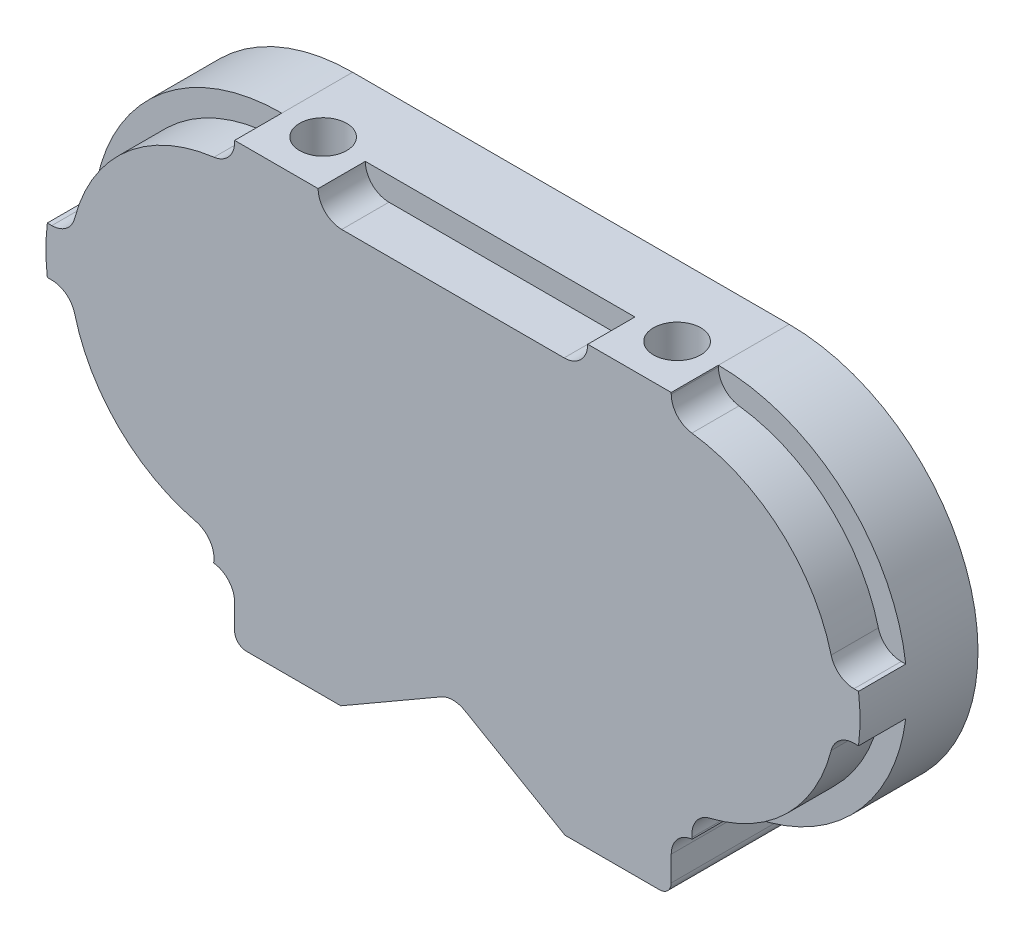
ISO-10303-21;
HEADER;
FILE_DESCRIPTION(('STEP AP214'),'2;1');
FILE_NAME('part.step','',(''),(''),'','','');
FILE_SCHEMA(('AUTOMOTIVE_DESIGN { 1 0 10303 214 1 1 1 1 }'));
ENDSEC;
DATA;
#1=APPLICATION_CONTEXT('core data for automotive mechanical design processes');
#2=APPLICATION_PROTOCOL_DEFINITION('international standard','automotive_design',2000,#1);
#3=PRODUCT_CONTEXT('',#1,'mechanical');
#4=PRODUCT('Part','Part','',(#3));
#5=PRODUCT_RELATED_PRODUCT_CATEGORY('part','',(#4));
#6=PRODUCT_DEFINITION_FORMATION('','',#4);
#7=PRODUCT_DEFINITION_CONTEXT('part definition',#1,'design');
#8=PRODUCT_DEFINITION('design','',#6,#7);
#9=PRODUCT_DEFINITION_SHAPE('','',#8);
#10=(LENGTH_UNIT() NAMED_UNIT(*) SI_UNIT(.MILLI.,.METRE.));
#11=(NAMED_UNIT(*) PLANE_ANGLE_UNIT() SI_UNIT($,.RADIAN.));
#12=(NAMED_UNIT(*) SI_UNIT($,.STERADIAN.) SOLID_ANGLE_UNIT());
#13=UNCERTAINTY_MEASURE_WITH_UNIT(LENGTH_MEASURE(1.E-05),#10,'distance_accuracy_value','');
#14=(GEOMETRIC_REPRESENTATION_CONTEXT(3) GLOBAL_UNCERTAINTY_ASSIGNED_CONTEXT((#13)) GLOBAL_UNIT_ASSIGNED_CONTEXT((#10,
#11,#12)) REPRESENTATION_CONTEXT('',''));
#15=CARTESIAN_POINT('',(0.,0.,0.));
#16=DIRECTION('',(0.,0.,1.));
#17=DIRECTION('',(1.,0.,0.));
#18=AXIS2_PLACEMENT_3D('',#15,#16,#17);
#19=CARTESIAN_POINT('',(26.,-18.,14.));
#20=DIRECTION('',(-1.,0.,0.));
#21=DIRECTION('',(0.,0.,1.));
#22=AXIS2_PLACEMENT_3D('',#19,#20,#21);
#23=PLANE('',#22);
#24=DIRECTION('',(0.,-1.,0.));
#25=VECTOR('',#24,1.);
#26=CARTESIAN_POINT('',(26.,-18.,6.));
#27=LINE('',#26,#25);
#28=CARTESIAN_POINT('',(26.,18.,6.));
#29=VERTEX_POINT('',#28);
#30=CARTESIAN_POINT('',(26.,-18.,6.));
#31=VERTEX_POINT('',#30);
#32=EDGE_CURVE('E422',#29,#31,#27,.T.);
#33=ORIENTED_EDGE('',*,*,#32,.F.);
#34=DIRECTION('',(0.,0.,-1.));
#35=VECTOR('',#34,1.);
#36=CARTESIAN_POINT('',(26.,18.,14.));
#37=LINE('',#36,#35);
#38=CARTESIAN_POINT('',(26.,18.,14.));
#39=VERTEX_POINT('',#38);
#40=EDGE_CURVE('E431',#39,#29,#37,.T.);
#41=ORIENTED_EDGE('',*,*,#40,.F.);
#42=DIRECTION('',(0.,1.,0.));
#43=VECTOR('',#42,1.);
#44=CARTESIAN_POINT('',(26.,-18.,14.));
#45=LINE('',#44,#43);
#46=CARTESIAN_POINT('',(26.,-18.,14.));
#47=VERTEX_POINT('',#46);
#48=EDGE_CURVE('E1430',#47,#39,#45,.T.);
#49=ORIENTED_EDGE('',*,*,#48,.F.);
#50=DIRECTION('',(0.,0.,-1.));
#51=VECTOR('',#50,1.);
#52=CARTESIAN_POINT('',(26.,-18.,14.));
#53=LINE('',#52,#51);
#54=EDGE_CURVE('E433',#47,#31,#53,.T.);
#55=ORIENTED_EDGE('',*,*,#54,.T.);
#56=EDGE_LOOP('',(#33,#41,#49,#55));
#57=FACE_BOUND('',#56,.T.);
#58=ADVANCED_FACE('F54',(#57),#23,.F.);
#59=CARTESIAN_POINT('',(74.,-18.,14.));
#60=DIRECTION('',(1.,0.,0.));
#61=DIRECTION('',(0.,0.,-1.));
#62=AXIS2_PLACEMENT_3D('',#59,#60,#61);
#63=PLANE('',#62);
#64=DIRECTION('',(0.,1.,0.));
#65=VECTOR('',#64,1.);
#66=CARTESIAN_POINT('',(74.,18.,6.));
#67=LINE('',#66,#65);
#68=CARTESIAN_POINT('',(74.,-18.,6.));
#69=VERTEX_POINT('',#68);
#70=CARTESIAN_POINT('',(74.,18.,6.));
#71=VERTEX_POINT('',#70);
#72=EDGE_CURVE('E1445',#69,#71,#67,.T.);
#73=ORIENTED_EDGE('',*,*,#72,.F.);
#74=DIRECTION('',(0.,0.,-1.));
#75=VECTOR('',#74,1.);
#76=CARTESIAN_POINT('',(74.,-18.,14.));
#77=LINE('',#76,#75);
#78=CARTESIAN_POINT('',(74.,-18.,14.));
#79=VERTEX_POINT('',#78);
#80=EDGE_CURVE('E444',#79,#69,#77,.T.);
#81=ORIENTED_EDGE('',*,*,#80,.F.);
#82=DIRECTION('',(0.,-1.,0.));
#83=VECTOR('',#82,1.);
#84=CARTESIAN_POINT('',(74.,-18.,14.));
#85=LINE('',#84,#83);
#86=CARTESIAN_POINT('',(74.,18.,14.));
#87=VERTEX_POINT('',#86);
#88=EDGE_CURVE('E1425',#87,#79,#85,.T.);
#89=ORIENTED_EDGE('',*,*,#88,.F.);
#90=DIRECTION('',(0.,0.,-1.));
#91=VECTOR('',#90,1.);
#92=CARTESIAN_POINT('',(74.,18.,14.));
#93=LINE('',#92,#91);
#94=EDGE_CURVE('E439',#87,#71,#93,.T.);
#95=ORIENTED_EDGE('',*,*,#94,.T.);
#96=EDGE_LOOP('',(#73,#81,#89,#95));
#97=FACE_BOUND('',#96,.T.);
#98=ADVANCED_FACE('F866',(#97),#63,.F.);
#99=CARTESIAN_POINT('',(87.,0.,20.));
#100=DIRECTION('',(0.,0.,-1.));
#101=DIRECTION('',(-1.,0.,0.));
#102=AXIS2_PLACEMENT_3D('',#99,#100,#101);
#103=CYLINDRICAL_SURFACE('',#102,32.);
#104=DIRECTION('',(0.,0.,1.));
#105=VECTOR('',#104,1.);
#106=CARTESIAN_POINT('',(118.749015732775,-4.00000000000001,12.));
#107=LINE('',#106,#105);
#108=CARTESIAN_POINT('',(118.749015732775,-4.00000000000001,12.));
#109=VERTEX_POINT('',#108);
#110=CARTESIAN_POINT('',(118.749015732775,-4.00000000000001,20.));
#111=VERTEX_POINT('',#110);
#112=EDGE_CURVE('E505',#109,#111,#107,.T.);
#113=ORIENTED_EDGE('',*,*,#112,.F.);
#114=CARTESIAN_POINT('',(87.,0.,12.));
#115=DIRECTION('',(0.,0.,1.));
#116=DIRECTION('',(1.,0.,0.));
#117=AXIS2_PLACEMENT_3D('',#114,#115,#116);
#118=CIRCLE('',#117,32.);
#119=CARTESIAN_POINT('',(90.5555555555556,-31.801855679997,12.));
#120=VERTEX_POINT('',#119);
#121=EDGE_CURVE('E540',#120,#109,#118,.T.);
#122=ORIENTED_EDGE('',*,*,#121,.F.);
#123=DIRECTION('',(0.,0.,-1.));
#124=VECTOR('',#123,1.);
#125=CARTESIAN_POINT('',(90.5555555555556,-31.801855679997,20.));
#126=LINE('',#125,#124);
#127=CARTESIAN_POINT('',(90.5555555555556,-31.801855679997,0.));
#128=VERTEX_POINT('',#127);
#129=EDGE_CURVE('E781',#120,#128,#126,.T.);
#130=ORIENTED_EDGE('',*,*,#129,.T.);
#131=CARTESIAN_POINT('',(87.,0.,0.));
#132=DIRECTION('',(0.,0.,1.));
#133=DIRECTION('',(1.,0.,0.));
#134=AXIS2_PLACEMENT_3D('',#131,#132,#133);
#135=CIRCLE('',#134,32.);
#136=CARTESIAN_POINT('',(87.,32.,0.));
#137=VERTEX_POINT('',#136);
#138=EDGE_CURVE('E769',#128,#137,#135,.T.);
#139=ORIENTED_EDGE('',*,*,#138,.T.);
#140=DIRECTION('',(0.,0.,-1.));
#141=VECTOR('',#140,1.);
#142=CARTESIAN_POINT('',(87.,32.,20.));
#143=LINE('',#142,#141);
#144=CARTESIAN_POINT('',(87.,32.,12.));
#145=VERTEX_POINT('',#144);
#146=EDGE_CURVE('E777',#145,#137,#143,.T.);
#147=ORIENTED_EDGE('',*,*,#146,.F.);
#148=CARTESIAN_POINT('',(87.,0.,12.));
#149=DIRECTION('',(0.,0.,1.));
#150=DIRECTION('',(1.,0.,0.));
#151=AXIS2_PLACEMENT_3D('',#148,#149,#150);
#152=CIRCLE('',#151,32.);
#153=CARTESIAN_POINT('',(118.749015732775,4.,12.));
#154=VERTEX_POINT('',#153);
#155=EDGE_CURVE('E645',#154,#145,#152,.T.);
#156=ORIENTED_EDGE('',*,*,#155,.F.);
#157=DIRECTION('',(0.,0.,1.));
#158=VECTOR('',#157,1.);
#159=CARTESIAN_POINT('',(118.749015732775,4.,12.));
#160=LINE('',#159,#158);
#161=CARTESIAN_POINT('',(118.749015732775,4.,20.));
#162=VERTEX_POINT('',#161);
#163=EDGE_CURVE('E619',#154,#162,#160,.T.);
#164=ORIENTED_EDGE('',*,*,#163,.T.);
#165=CARTESIAN_POINT('',(87.,0.,20.));
#166=DIRECTION('',(0.,0.,1.));
#167=DIRECTION('',(1.,0.,0.));
#168=AXIS2_PLACEMENT_3D('',#165,#166,#167);
#169=CIRCLE('',#168,32.);
#170=EDGE_CURVE('E736',#111,#162,#169,.T.);
#171=ORIENTED_EDGE('',*,*,#170,.F.);
#172=EDGE_LOOP('',(#113,#122,#130,#139,#147,#156,#164,#171));
#173=FACE_BOUND('',#172,.T.);
#174=ADVANCED_FACE('F871',(#173),#103,.T.);
#175=CARTESIAN_POINT('',(13.,0.,20.));
#176=DIRECTION('',(0.,0.,1.));
#177=DIRECTION('',(1.,0.,0.));
#178=AXIS2_PLACEMENT_3D('',#175,#176,#177);
#179=PLANE('',#178);
#180=DIRECTION('',(0.111111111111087,-0.993807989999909,0.));
#181=VECTOR('',#180,1.);
#182=CARTESIAN_POINT('',(90.5276684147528,-31.5524255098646,20.));
#183=LINE('',#182,#181);
#184=CARTESIAN_POINT('',(90.5276684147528,-31.5524255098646,20.));
#185=VERTEX_POINT('',#184);
#186=CARTESIAN_POINT('',(90.5555555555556,-31.801855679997,20.));
#187=VERTEX_POINT('',#186);
#188=EDGE_CURVE('E528',#185,#187,#183,.T.);
#189=ORIENTED_EDGE('',*,*,#188,.F.);
#190=CARTESIAN_POINT('',(94.5029003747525,-31.1079810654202,20.));
#191=DIRECTION('',(0.,0.,1.));
#192=DIRECTION('',(1.,0.,0.));
#193=AXIS2_PLACEMENT_3D('',#190,#191,#192);
#194=CIRCLE('',#193,4.);
#195=CARTESIAN_POINT('',(93.5650378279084,-27.2194834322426,20.));
#196=VERTEX_POINT('',#195);
#197=EDGE_CURVE('E515',#196,#185,#194,.T.);
#198=ORIENTED_EDGE('',*,*,#197,.F.);
#199=CARTESIAN_POINT('',(87.,0.,20.));
#200=DIRECTION('',(0.,0.,-1.));
#201=DIRECTION('',(-1.,0.,0.));
#202=AXIS2_PLACEMENT_3D('',#199,#200,#201);
#203=CIRCLE('',#202,28.);
#204=CARTESIAN_POINT('',(114.110883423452,-7.,20.));
#205=VERTEX_POINT('',#204);
#206=EDGE_CURVE('E518',#205,#196,#203,.T.);
#207=ORIENTED_EDGE('',*,*,#206,.F.);
#208=CARTESIAN_POINT('',(117.983866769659,-8.,20.));
#209=DIRECTION('',(0.,0.,-1.));
#210=DIRECTION('',(-1.,0.,0.));
#211=AXIS2_PLACEMENT_3D('',#208,#209,#210);
#212=CIRCLE('',#211,4.);
#213=CARTESIAN_POINT('',(117.983866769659,-4.,20.));
#214=VERTEX_POINT('',#213);
#215=EDGE_CURVE('E522',#205,#214,#212,.T.);
#216=ORIENTED_EDGE('',*,*,#215,.T.);
#217=DIRECTION('',(1.,0.,0.));
#218=VECTOR('',#217,1.);
#219=CARTESIAN_POINT('',(117.983866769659,-4.,20.));
#220=LINE('',#219,#218);
#221=EDGE_CURVE('E525',#214,#111,#220,.T.);
#222=ORIENTED_EDGE('',*,*,#221,.T.);
#223=ORIENTED_EDGE('',*,*,#170,.T.);
#224=DIRECTION('',(1.,0.,0.));
#225=VECTOR('',#224,1.);
#226=CARTESIAN_POINT('',(117.983866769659,4.,20.));
#227=LINE('',#226,#225);
#228=CARTESIAN_POINT('',(117.983866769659,4.,20.));
#229=VERTEX_POINT('',#228);
#230=EDGE_CURVE('E632',#229,#162,#227,.T.);
#231=ORIENTED_EDGE('',*,*,#230,.F.);
#232=CARTESIAN_POINT('',(117.983866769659,8.,20.));
#233=DIRECTION('',(0.,0.,1.));
#234=DIRECTION('',(1.,0.,0.));
#235=AXIS2_PLACEMENT_3D('',#232,#233,#234);
#236=CIRCLE('',#235,4.);
#237=CARTESIAN_POINT('',(114.110883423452,7.,20.));
#238=VERTEX_POINT('',#237);
#239=EDGE_CURVE('E635',#238,#229,#236,.T.);
#240=ORIENTED_EDGE('',*,*,#239,.F.);
#241=CARTESIAN_POINT('',(87.,0.,20.));
#242=DIRECTION('',(0.,0.,-1.));
#243=DIRECTION('',(-1.,0.,0.));
#244=AXIS2_PLACEMENT_3D('',#241,#242,#243);
#245=CIRCLE('',#244,28.);
#246=CARTESIAN_POINT('',(90.5,27.7803887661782,20.));
#247=VERTEX_POINT('',#246);
#248=EDGE_CURVE('E638',#247,#238,#245,.T.);
#249=ORIENTED_EDGE('',*,*,#248,.F.);
#250=CARTESIAN_POINT('',(91.,31.7490157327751,20.));
#251=DIRECTION('',(0.,0.,-1.));
#252=DIRECTION('',(-1.,0.,0.));
#253=AXIS2_PLACEMENT_3D('',#250,#251,#252);
#254=CIRCLE('',#253,4.);
#255=CARTESIAN_POINT('',(87.,31.7490157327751,20.));
#256=VERTEX_POINT('',#255);
#257=EDGE_CURVE('E625',#247,#256,#254,.T.);
#258=ORIENTED_EDGE('',*,*,#257,.T.);
#259=DIRECTION('',(0.,-1.,0.));
#260=VECTOR('',#259,1.);
#261=CARTESIAN_POINT('',(87.,32.,20.));
#262=LINE('',#261,#260);
#263=CARTESIAN_POINT('',(87.,32.,20.));
#264=VERTEX_POINT('',#263);
#265=EDGE_CURVE('E628',#264,#256,#262,.T.);
#266=ORIENTED_EDGE('',*,*,#265,.F.);
#267=DIRECTION('',(-1.,0.,0.));
#268=VECTOR('',#267,1.);
#269=CARTESIAN_POINT('',(13.,32.,20.));
#270=LINE('',#269,#268);
#271=CARTESIAN_POINT('',(72.84908603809,32.,20.));
#272=VERTEX_POINT('',#271);
#273=EDGE_CURVE('E739',#264,#272,#270,.T.);
#274=ORIENTED_EDGE('',*,*,#273,.T.);
#275=CARTESIAN_POINT('',(68.84908603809,32.,20.));
#276=DIRECTION('',(0.,0.,-1.));
#277=DIRECTION('',(-1.,0.,0.));
#278=AXIS2_PLACEMENT_3D('',#275,#276,#277);
#279=CIRCLE('',#278,4.);
#280=CARTESIAN_POINT('',(68.84908603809,28.,20.));
#281=VERTEX_POINT('',#280);
#282=EDGE_CURVE('E600',#272,#281,#279,.T.);
#283=ORIENTED_EDGE('',*,*,#282,.T.);
#284=DIRECTION('',(-1.,0.,0.));
#285=VECTOR('',#284,1.);
#286=CARTESIAN_POINT('',(68.84908603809,28.,20.));
#287=LINE('',#286,#285);
#288=CARTESIAN_POINT('',(31.1509139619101,28.,20.));
#289=VERTEX_POINT('',#288);
#290=EDGE_CURVE('E596',#281,#289,#287,.T.);
#291=ORIENTED_EDGE('',*,*,#290,.T.);
#292=CARTESIAN_POINT('',(31.1509139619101,32.,20.));
#293=DIRECTION('',(0.,0.,1.));
#294=DIRECTION('',(1.,0.,0.));
#295=AXIS2_PLACEMENT_3D('',#292,#293,#294);
#296=CIRCLE('',#295,4.);
#297=CARTESIAN_POINT('',(27.1509139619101,32.,20.));
#298=VERTEX_POINT('',#297);
#299=EDGE_CURVE('E593',#298,#289,#296,.T.);
#300=ORIENTED_EDGE('',*,*,#299,.F.);
#301=CARTESIAN_POINT('',(13.,32.,20.));
#302=VERTEX_POINT('',#301);
#303=EDGE_CURVE('E738',#298,#302,#270,.T.);
#304=ORIENTED_EDGE('',*,*,#303,.T.);
#305=DIRECTION('',(0.,-1.,0.));
#306=VECTOR('',#305,1.);
#307=CARTESIAN_POINT('',(13.,32.,20.));
#308=LINE('',#307,#306);
#309=CARTESIAN_POINT('',(13.,31.7490157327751,20.));
#310=VERTEX_POINT('',#309);
#311=EDGE_CURVE('E564',#302,#310,#308,.T.);
#312=ORIENTED_EDGE('',*,*,#311,.T.);
#313=CARTESIAN_POINT('',(9.00000000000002,31.7490157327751,20.));
#314=DIRECTION('',(0.,0.,1.));
#315=DIRECTION('',(1.,0.,0.));
#316=AXIS2_PLACEMENT_3D('',#313,#314,#315);
#317=CIRCLE('',#316,4.);
#318=CARTESIAN_POINT('',(9.50000000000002,27.7803887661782,20.));
#319=VERTEX_POINT('',#318);
#320=EDGE_CURVE('E567',#319,#310,#317,.T.);
#321=ORIENTED_EDGE('',*,*,#320,.F.);
#322=CARTESIAN_POINT('',(13.,0.,20.));
#323=DIRECTION('',(0.,0.,1.));
#324=DIRECTION('',(1.,0.,0.));
#325=AXIS2_PLACEMENT_3D('',#322,#323,#324);
#326=CIRCLE('',#325,28.);
#327=CARTESIAN_POINT('',(-14.1108834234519,7.,20.));
#328=VERTEX_POINT('',#327);
#329=EDGE_CURVE('E554',#319,#328,#326,.T.);
#330=ORIENTED_EDGE('',*,*,#329,.T.);
#331=CARTESIAN_POINT('',(-17.9838667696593,8.,20.));
#332=DIRECTION('',(0.,0.,-1.));
#333=DIRECTION('',(-1.,0.,0.));
#334=AXIS2_PLACEMENT_3D('',#331,#332,#333);
#335=CIRCLE('',#334,4.);
#336=CARTESIAN_POINT('',(-17.9838667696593,4.,20.));
#337=VERTEX_POINT('',#336);
#338=EDGE_CURVE('E557',#328,#337,#335,.T.);
#339=ORIENTED_EDGE('',*,*,#338,.T.);
#340=DIRECTION('',(-1.,0.,0.));
#341=VECTOR('',#340,1.);
#342=CARTESIAN_POINT('',(-17.9838667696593,4.,20.));
#343=LINE('',#342,#341);
#344=CARTESIAN_POINT('',(-18.7490157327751,4.,20.));
#345=VERTEX_POINT('',#344);
#346=EDGE_CURVE('E561',#337,#345,#343,.T.);
#347=ORIENTED_EDGE('',*,*,#346,.T.);
#348=CARTESIAN_POINT('',(13.,0.,20.));
#349=DIRECTION('',(0.,0.,1.));
#350=DIRECTION('',(1.,0.,0.));
#351=AXIS2_PLACEMENT_3D('',#348,#349,#350);
#352=CIRCLE('',#351,32.);
#353=CARTESIAN_POINT('',(-18.7490157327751,-4.,20.));
#354=VERTEX_POINT('',#353);
#355=EDGE_CURVE('E710',#345,#354,#352,.T.);
#356=ORIENTED_EDGE('',*,*,#355,.T.);
#357=DIRECTION('',(-1.,0.,0.));
#358=VECTOR('',#357,1.);
#359=CARTESIAN_POINT('',(-17.9838667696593,-4.,20.));
#360=LINE('',#359,#358);
#361=CARTESIAN_POINT('',(-17.9838667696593,-4.,20.));
#362=VERTEX_POINT('',#361);
#363=EDGE_CURVE('E683',#362,#354,#360,.T.);
#364=ORIENTED_EDGE('',*,*,#363,.F.);
#365=CARTESIAN_POINT('',(-17.9838667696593,-8.,20.));
#366=DIRECTION('',(0.,0.,1.));
#367=DIRECTION('',(1.,0.,0.));
#368=AXIS2_PLACEMENT_3D('',#365,#366,#367);
#369=CIRCLE('',#368,4.);
#370=CARTESIAN_POINT('',(-14.1108834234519,-7.,20.));
#371=VERTEX_POINT('',#370);
#372=EDGE_CURVE('E660',#371,#362,#369,.T.);
#373=ORIENTED_EDGE('',*,*,#372,.F.);
#374=CARTESIAN_POINT('',(13.,0.,20.));
#375=DIRECTION('',(0.,0.,1.));
#376=DIRECTION('',(1.,0.,0.));
#377=AXIS2_PLACEMENT_3D('',#374,#375,#376);
#378=CIRCLE('',#377,28.);
#379=CARTESIAN_POINT('',(6.43496217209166,-27.2194834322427,20.));
#380=VERTEX_POINT('',#379);
#381=EDGE_CURVE('E640',#371,#380,#378,.T.);
#382=ORIENTED_EDGE('',*,*,#381,.T.);
#383=CARTESIAN_POINT('',(5.49709962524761,-31.1079810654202,20.));
#384=DIRECTION('',(0.,0.,-1.));
#385=DIRECTION('',(-1.,0.,0.));
#386=AXIS2_PLACEMENT_3D('',#383,#384,#385);
#387=CIRCLE('',#386,4.);
#388=CARTESIAN_POINT('',(9.47233158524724,-31.5524255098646,20.));
#389=VERTEX_POINT('',#388);
#390=EDGE_CURVE('E677',#380,#389,#387,.T.);
#391=ORIENTED_EDGE('',*,*,#390,.T.);
#392=DIRECTION('',(0.111111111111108,0.993807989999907,0.));
#393=VECTOR('',#392,1.);
#394=CARTESIAN_POINT('',(9.44444444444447,-31.801855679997,20.));
#395=LINE('',#394,#393);
#396=CARTESIAN_POINT('',(9.44444444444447,-31.801855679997,20.));
#397=VERTEX_POINT('',#396);
#398=EDGE_CURVE('E680',#397,#389,#395,.T.);
#399=ORIENTED_EDGE('',*,*,#398,.F.);
#400=CARTESIAN_POINT('',(9.00000000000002,-35.7770876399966,20.));
#401=DIRECTION('',(0.,0.,-1.));
#402=DIRECTION('',(1.,0.,0.));
#403=AXIS2_PLACEMENT_3D('',#400,#401,#402);
#404=CIRCLE('',#403,4.);
#405=CARTESIAN_POINT('',(13.,-35.7770876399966,20.));
#406=VERTEX_POINT('',#405);
#407=EDGE_CURVE('E712',#397,#406,#404,.T.);
#408=ORIENTED_EDGE('',*,*,#407,.T.);
#409=DIRECTION('',(0.,-1.,0.));
#410=VECTOR('',#409,1.);
#411=CARTESIAN_POINT('',(13.,-35.7770876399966,20.));
#412=LINE('',#411,#410);
#413=CARTESIAN_POINT('',(13.,-40.,20.));
#414=VERTEX_POINT('',#413);
#415=EDGE_CURVE('E715',#406,#414,#412,.T.);
#416=ORIENTED_EDGE('',*,*,#415,.T.);
#417=CARTESIAN_POINT('',(15.,-40.,20.));
#418=DIRECTION('',(0.,0.,1.));
#419=DIRECTION('',(1.,0.,0.));
#420=AXIS2_PLACEMENT_3D('',#417,#418,#419);
#421=CIRCLE('',#420,2.);
#422=CARTESIAN_POINT('',(15.,-42.,20.));
#423=VERTEX_POINT('',#422);
#424=EDGE_CURVE('E717',#414,#423,#421,.T.);
#425=ORIENTED_EDGE('',*,*,#424,.T.);
#426=DIRECTION('',(1.,0.,0.));
#427=VECTOR('',#426,1.);
#428=CARTESIAN_POINT('',(15.,-42.,20.));
#429=LINE('',#428,#427);
#430=CARTESIAN_POINT('',(31.,-42.,20.));
#431=VERTEX_POINT('',#430);
#432=EDGE_CURVE('E719',#423,#431,#429,.T.);
#433=ORIENTED_EDGE('',*,*,#432,.T.);
#434=DIRECTION('',(0.86602540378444,0.499999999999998,0.));
#435=VECTOR('',#434,1.);
#436=CARTESIAN_POINT('',(48.,-32.1850454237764,20.));
#437=LINE('',#436,#435);
#438=CARTESIAN_POINT('',(48.,-32.1850454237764,20.));
#439=VERTEX_POINT('',#438);
#440=EDGE_CURVE('E721',#431,#439,#437,.T.);
#441=ORIENTED_EDGE('',*,*,#440,.T.);
#442=CARTESIAN_POINT('',(50.,-35.6491470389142,20.));
#443=DIRECTION('',(0.,0.,-1.));
#444=DIRECTION('',(-1.,0.,0.));
#445=AXIS2_PLACEMENT_3D('',#442,#443,#444);
#446=CIRCLE('',#445,4.);
#447=CARTESIAN_POINT('',(52.,-32.1850454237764,20.));
#448=VERTEX_POINT('',#447);
#449=EDGE_CURVE('E723',#439,#448,#446,.T.);
#450=ORIENTED_EDGE('',*,*,#449,.T.);
#451=DIRECTION('',(0.86602540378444,-0.499999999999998,0.));
#452=VECTOR('',#451,1.);
#453=CARTESIAN_POINT('',(52.,-32.1850454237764,20.));
#454=LINE('',#453,#452);
#455=CARTESIAN_POINT('',(69.,-42.,20.));
#456=VERTEX_POINT('',#455);
#457=EDGE_CURVE('E725',#448,#456,#454,.T.);
#458=ORIENTED_EDGE('',*,*,#457,.T.);
#459=DIRECTION('',(1.,0.,0.));
#460=VECTOR('',#459,1.);
#461=CARTESIAN_POINT('',(69.,-42.,20.));
#462=LINE('',#461,#460);
#463=CARTESIAN_POINT('',(85.,-42.,20.));
#464=VERTEX_POINT('',#463);
#465=EDGE_CURVE('E727',#456,#464,#462,.T.);
#466=ORIENTED_EDGE('',*,*,#465,.T.);
#467=CARTESIAN_POINT('',(85.,-40.,20.));
#468=DIRECTION('',(0.,0.,1.));
#469=DIRECTION('',(1.,0.,0.));
#470=AXIS2_PLACEMENT_3D('',#467,#468,#469);
#471=CIRCLE('',#470,2.);
#472=CARTESIAN_POINT('',(87.,-40.,20.));
#473=VERTEX_POINT('',#472);
#474=EDGE_CURVE('E729',#464,#473,#471,.T.);
#475=ORIENTED_EDGE('',*,*,#474,.T.);
#476=DIRECTION('',(0.,1.,0.));
#477=VECTOR('',#476,1.);
#478=CARTESIAN_POINT('',(87.,-40.,20.));
#479=LINE('',#478,#477);
#480=CARTESIAN_POINT('',(87.,-35.7770876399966,20.));
#481=VERTEX_POINT('',#480);
#482=EDGE_CURVE('E731',#473,#481,#479,.T.);
#483=ORIENTED_EDGE('',*,*,#482,.T.);
#484=CARTESIAN_POINT('',(91.,-35.7770876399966,20.));
#485=DIRECTION('',(0.,0.,-1.));
#486=DIRECTION('',(-1.,0.,0.));
#487=AXIS2_PLACEMENT_3D('',#484,#485,#486);
#488=CIRCLE('',#487,4.);
#489=EDGE_CURVE('E733',#481,#187,#488,.T.);
#490=ORIENTED_EDGE('',*,*,#489,.T.);
#491=EDGE_LOOP('',(#189,#198,#207,#216,#222,#223,#231,#240,#249,#258,#266,#274,#283,#291,#300,
#304,#312,#321,#330,#339,#347,#356,#364,#373,#382,#391,#399,#408,#416,#425,#433,#441,#450,#458,
#466,#475,#483,#490));
#492=FACE_BOUND('',#491,.T.);
#493=ADVANCED_FACE('F1040',(#492),#179,.T.);
#494=CARTESIAN_POINT('',(13.,0.,20.));
#495=DIRECTION('',(0.,0.,-1.));
#496=DIRECTION('',(-1.,0.,0.));
#497=AXIS2_PLACEMENT_3D('',#494,#495,#496);
#498=CYLINDRICAL_SURFACE('',#497,32.);
#499=DIRECTION('',(0.,0.,1.));
#500=VECTOR('',#499,1.);
#501=CARTESIAN_POINT('',(-18.7490157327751,4.,12.));
#502=LINE('',#501,#500);
#503=CARTESIAN_POINT('',(-18.7490157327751,4.,12.));
#504=VERTEX_POINT('',#503);
#505=EDGE_CURVE('E547',#504,#345,#502,.T.);
#506=ORIENTED_EDGE('',*,*,#505,.F.);
#507=CARTESIAN_POINT('',(13.,0.,12.));
#508=DIRECTION('',(0.,0.,1.));
#509=DIRECTION('',(1.,0.,0.));
#510=AXIS2_PLACEMENT_3D('',#507,#508,#509);
#511=CIRCLE('',#510,32.);
#512=CARTESIAN_POINT('',(13.,32.,12.));
#513=VERTEX_POINT('',#512);
#514=EDGE_CURVE('E576',#513,#504,#511,.T.);
#515=ORIENTED_EDGE('',*,*,#514,.F.);
#516=DIRECTION('',(0.,0.,-1.));
#517=VECTOR('',#516,1.);
#518=CARTESIAN_POINT('',(13.,32.,20.));
#519=LINE('',#518,#517);
#520=CARTESIAN_POINT('',(13.,32.,0.));
#521=VERTEX_POINT('',#520);
#522=EDGE_CURVE('E742',#513,#521,#519,.T.);
#523=ORIENTED_EDGE('',*,*,#522,.T.);
#524=CARTESIAN_POINT('',(13.,0.,0.));
#525=DIRECTION('',(0.,0.,1.));
#526=DIRECTION('',(1.,0.,0.));
#527=AXIS2_PLACEMENT_3D('',#524,#525,#526);
#528=CIRCLE('',#527,32.);
#529=CARTESIAN_POINT('',(9.44444444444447,-31.801855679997,0.));
#530=VERTEX_POINT('',#529);
#531=EDGE_CURVE('E743',#521,#530,#528,.T.);
#532=ORIENTED_EDGE('',*,*,#531,.T.);
#533=DIRECTION('',(0.,0.,-1.));
#534=VECTOR('',#533,1.);
#535=CARTESIAN_POINT('',(9.44444444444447,-31.801855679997,20.));
#536=LINE('',#535,#534);
#537=CARTESIAN_POINT('',(9.44444444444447,-31.801855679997,12.));
#538=VERTEX_POINT('',#537);
#539=EDGE_CURVE('E815',#538,#530,#536,.T.);
#540=ORIENTED_EDGE('',*,*,#539,.F.);
#541=CARTESIAN_POINT('',(13.,0.,12.));
#542=DIRECTION('',(0.,0.,1.));
#543=DIRECTION('',(1.,0.,0.));
#544=AXIS2_PLACEMENT_3D('',#541,#542,#543);
#545=CIRCLE('',#544,32.);
#546=CARTESIAN_POINT('',(-18.7490157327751,-4.,12.));
#547=VERTEX_POINT('',#546);
#548=EDGE_CURVE('E665',#547,#538,#545,.T.);
#549=ORIENTED_EDGE('',*,*,#548,.F.);
#550=DIRECTION('',(0.,0.,1.));
#551=VECTOR('',#550,1.);
#552=CARTESIAN_POINT('',(-18.7490157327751,-4.,12.));
#553=LINE('',#552,#551);
#554=EDGE_CURVE('E692',#547,#354,#553,.T.);
#555=ORIENTED_EDGE('',*,*,#554,.T.);
#556=ORIENTED_EDGE('',*,*,#355,.F.);
#557=EDGE_LOOP('',(#506,#515,#523,#532,#540,#549,#555,#556));
#558=FACE_BOUND('',#557,.T.);
#559=ADVANCED_FACE('F854',(#558),#498,.T.);
#560=CARTESIAN_POINT('',(13.,32.,20.));
#561=DIRECTION('',(0.,-1.,0.));
#562=DIRECTION('',(0.,0.,-1.));
#563=AXIS2_PLACEMENT_3D('',#560,#561,#562);
#564=PLANE('',#563);
#565=CARTESIAN_POINT('',(80.,32.,12.));
#566=DIRECTION('',(0.,-1.,0.));
#567=DIRECTION('',(0.,0.,-1.));
#568=AXIS2_PLACEMENT_3D('',#565,#566,#567);
#569=CIRCLE('',#568,4.00000000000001);
#570=CARTESIAN_POINT('',(80.,32.,7.99999999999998));
#571=VERTEX_POINT('',#570);
#572=EDGE_CURVE('E703',#571,#571,#569,.F.);
#573=ORIENTED_EDGE('',*,*,#572,.F.);
#574=EDGE_LOOP('',(#573));
#575=FACE_BOUND('',#574,.T.);
#576=CARTESIAN_POINT('',(20.,32.,12.));
#577=DIRECTION('',(0.,-1.,0.));
#578=DIRECTION('',(0.,0.,-1.));
#579=AXIS2_PLACEMENT_3D('',#576,#577,#578);
#580=CIRCLE('',#579,4.);
#581=CARTESIAN_POINT('',(20.,32.,8.));
#582=VERTEX_POINT('',#581);
#583=EDGE_CURVE('E709',#582,#582,#580,.F.);
#584=ORIENTED_EDGE('',*,*,#583,.F.);
#585=EDGE_LOOP('',(#584));
#586=FACE_BOUND('',#585,.T.);
#587=DIRECTION('',(0.,0.,1.));
#588=VECTOR('',#587,1.);
#589=CARTESIAN_POINT('',(72.84908603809,32.,12.));
#590=LINE('',#589,#588);
#591=CARTESIAN_POINT('',(72.84908603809,32.,12.));
#592=VERTEX_POINT('',#591);
#593=EDGE_CURVE('E589',#592,#272,#590,.T.);
#594=ORIENTED_EDGE('',*,*,#593,.T.);
#595=ORIENTED_EDGE('',*,*,#273,.F.);
#596=EDGE_CURVE('E778',#264,#145,#143,.T.);
#597=ORIENTED_EDGE('',*,*,#596,.T.);
#598=ORIENTED_EDGE('',*,*,#146,.T.);
#599=DIRECTION('',(-1.,0.,0.));
#600=VECTOR('',#599,1.);
#601=CARTESIAN_POINT('',(13.,32.,0.));
#602=LINE('',#601,#600);
#603=EDGE_CURVE('E713',#137,#521,#602,.T.);
#604=ORIENTED_EDGE('',*,*,#603,.T.);
#605=ORIENTED_EDGE('',*,*,#522,.F.);
#606=EDGE_CURVE('E774',#302,#513,#519,.T.);
#607=ORIENTED_EDGE('',*,*,#606,.F.);
#608=ORIENTED_EDGE('',*,*,#303,.F.);
#609=DIRECTION('',(0.,0.,1.));
#610=VECTOR('',#609,1.);
#611=CARTESIAN_POINT('',(27.1509139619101,32.,12.));
#612=LINE('',#611,#610);
#613=CARTESIAN_POINT('',(27.1509139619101,32.,12.));
#614=VERTEX_POINT('',#613);
#615=EDGE_CURVE('E587',#614,#298,#612,.T.);
#616=ORIENTED_EDGE('',*,*,#615,.F.);
#617=DIRECTION('',(-1.,0.,0.));
#618=VECTOR('',#617,1.);
#619=CARTESIAN_POINT('',(72.84908603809,32.,12.));
#620=LINE('',#619,#618);
#621=EDGE_CURVE('E592',#592,#614,#620,.T.);
#622=ORIENTED_EDGE('',*,*,#621,.F.);
#623=EDGE_LOOP('',(#594,#595,#597,#598,#604,#605,#607,#608,#616,#622));
#624=FACE_BOUND('',#623,.T.);
#625=ADVANCED_FACE('F1047',(#575,#586,#624),#564,.F.);
#626=CARTESIAN_POINT('',(69.,-42.,20.));
#627=DIRECTION('',(0.,1.,0.));
#628=DIRECTION('',(0.,0.,1.));
#629=AXIS2_PLACEMENT_3D('',#626,#627,#628);
#630=PLANE('',#629);
#631=DIRECTION('',(1.,0.,0.));
#632=VECTOR('',#631,1.);
#633=CARTESIAN_POINT('',(69.,-42.,0.));
#634=LINE('',#633,#632);
#635=CARTESIAN_POINT('',(69.,-42.,0.));
#636=VERTEX_POINT('',#635);
#637=CARTESIAN_POINT('',(85.,-42.,0.));
#638=VERTEX_POINT('',#637);
#639=EDGE_CURVE('E760',#636,#638,#634,.T.);
#640=ORIENTED_EDGE('',*,*,#639,.T.);
#641=DIRECTION('',(0.,0.,-1.));
#642=VECTOR('',#641,1.);
#643=CARTESIAN_POINT('',(85.,-42.,20.));
#644=LINE('',#643,#642);
#645=EDGE_CURVE('E791',#464,#638,#644,.T.);
#646=ORIENTED_EDGE('',*,*,#645,.F.);
#647=ORIENTED_EDGE('',*,*,#465,.F.);
#648=DIRECTION('',(0.,0.,-1.));
#649=VECTOR('',#648,1.);
#650=CARTESIAN_POINT('',(69.,-42.,20.));
#651=LINE('',#650,#649);
#652=EDGE_CURVE('E794',#456,#636,#651,.T.);
#653=ORIENTED_EDGE('',*,*,#652,.T.);
#654=EDGE_LOOP('',(#640,#646,#647,#653));
#655=FACE_BOUND('',#654,.T.);
#656=CARTESIAN_POINT('',(80.,-42.,12.));
#657=DIRECTION('',(0.,1.,0.));
#658=DIRECTION('',(0.,0.,1.));
#659=AXIS2_PLACEMENT_3D('',#656,#657,#658);
#660=CIRCLE('',#659,4.00000000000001);
#661=CARTESIAN_POINT('',(80.,-42.,16.));
#662=VERTEX_POINT('',#661);
#663=EDGE_CURVE('E700',#662,#662,#660,.T.);
#664=ORIENTED_EDGE('',*,*,#663,.T.);
#665=EDGE_LOOP('',(#664));
#666=FACE_BOUND('',#665,.T.);
#667=ADVANCED_FACE('F1050',(#655,#666),#630,.F.);
#668=CARTESIAN_POINT('',(15.,-42.,20.));
#669=DIRECTION('',(0.,1.,0.));
#670=DIRECTION('',(0.,0.,1.));
#671=AXIS2_PLACEMENT_3D('',#668,#669,#670);
#672=PLANE('',#671);
#673=DIRECTION('',(1.,0.,0.));
#674=VECTOR('',#673,1.);
#675=CARTESIAN_POINT('',(15.,-42.,0.));
#676=LINE('',#675,#674);
#677=CARTESIAN_POINT('',(15.,-42.,0.));
#678=VERTEX_POINT('',#677);
#679=CARTESIAN_POINT('',(31.,-42.,0.));
#680=VERTEX_POINT('',#679);
#681=EDGE_CURVE('E752',#678,#680,#676,.T.);
#682=ORIENTED_EDGE('',*,*,#681,.T.);
#683=DIRECTION('',(0.,0.,-1.));
#684=VECTOR('',#683,1.);
#685=CARTESIAN_POINT('',(31.,-42.,20.));
#686=LINE('',#685,#684);
#687=EDGE_CURVE('E803',#431,#680,#686,.T.);
#688=ORIENTED_EDGE('',*,*,#687,.F.);
#689=ORIENTED_EDGE('',*,*,#432,.F.);
#690=DIRECTION('',(0.,0.,-1.));
#691=VECTOR('',#690,1.);
#692=CARTESIAN_POINT('',(15.,-42.,20.));
#693=LINE('',#692,#691);
#694=EDGE_CURVE('E806',#423,#678,#693,.T.);
#695=ORIENTED_EDGE('',*,*,#694,.T.);
#696=EDGE_LOOP('',(#682,#688,#689,#695));
#697=FACE_BOUND('',#696,.T.);
#698=CARTESIAN_POINT('',(20.,-42.,12.));
#699=DIRECTION('',(0.,1.,0.));
#700=DIRECTION('',(0.,0.,1.));
#701=AXIS2_PLACEMENT_3D('',#698,#699,#700);
#702=CIRCLE('',#701,4.);
#703=CARTESIAN_POINT('',(20.,-42.,16.));
#704=VERTEX_POINT('',#703);
#705=EDGE_CURVE('E706',#704,#704,#702,.T.);
#706=ORIENTED_EDGE('',*,*,#705,.T.);
#707=EDGE_LOOP('',(#706));
#708=FACE_BOUND('',#707,.T.);
#709=ADVANCED_FACE('F1069',(#697,#708),#672,.F.);
#710=CARTESIAN_POINT('',(9.00000000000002,-35.7770876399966,20.));
#711=DIRECTION('',(0.,0.,-1.));
#712=DIRECTION('',(-1.,0.,0.));
#713=AXIS2_PLACEMENT_3D('',#710,#711,#712);
#714=CYLINDRICAL_SURFACE('',#713,4.);
#715=CARTESIAN_POINT('',(9.00000000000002,-35.7770876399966,0.));
#716=DIRECTION('',(0.,0.,-1.));
#717=DIRECTION('',(1.,0.,0.));
#718=AXIS2_PLACEMENT_3D('',#715,#716,#717);
#719=CIRCLE('',#718,4.);
#720=CARTESIAN_POINT('',(13.,-35.7770876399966,0.));
#721=VERTEX_POINT('',#720);
#722=EDGE_CURVE('E746',#530,#721,#719,.T.);
#723=ORIENTED_EDGE('',*,*,#722,.T.);
#724=DIRECTION('',(0.,0.,-1.));
#725=VECTOR('',#724,1.);
#726=CARTESIAN_POINT('',(13.,-35.7770876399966,20.));
#727=LINE('',#726,#725);
#728=EDGE_CURVE('E812',#406,#721,#727,.T.);
#729=ORIENTED_EDGE('',*,*,#728,.F.);
#730=ORIENTED_EDGE('',*,*,#407,.F.);
#731=EDGE_CURVE('E816',#397,#538,#536,.T.);
#732=ORIENTED_EDGE('',*,*,#731,.T.);
#733=ORIENTED_EDGE('',*,*,#539,.T.);
#734=EDGE_LOOP('',(#723,#729,#730,#732,#733));
#735=FACE_BOUND('',#734,.T.);
#736=ADVANCED_FACE('F1085',(#735),#714,.F.);
#737=CARTESIAN_POINT('',(13.,-35.7770876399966,20.));
#738=DIRECTION('',(1.,0.,0.));
#739=DIRECTION('',(0.,0.,-1.));
#740=AXIS2_PLACEMENT_3D('',#737,#738,#739);
#741=PLANE('',#740);
#742=DIRECTION('',(0.,-1.,0.));
#743=VECTOR('',#742,1.);
#744=CARTESIAN_POINT('',(13.,-35.7770876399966,0.));
#745=LINE('',#744,#743);
#746=CARTESIAN_POINT('',(13.,-40.,0.));
#747=VERTEX_POINT('',#746);
#748=EDGE_CURVE('E748',#721,#747,#745,.T.);
#749=ORIENTED_EDGE('',*,*,#748,.T.);
#750=DIRECTION('',(0.,0.,-1.));
#751=VECTOR('',#750,1.);
#752=CARTESIAN_POINT('',(13.,-40.,20.));
#753=LINE('',#752,#751);
#754=EDGE_CURVE('E809',#414,#747,#753,.T.);
#755=ORIENTED_EDGE('',*,*,#754,.F.);
#756=ORIENTED_EDGE('',*,*,#415,.F.);
#757=ORIENTED_EDGE('',*,*,#728,.T.);
#758=EDGE_LOOP('',(#749,#755,#756,#757));
#759=FACE_BOUND('',#758,.T.);
#760=ADVANCED_FACE('F1089',(#759),#741,.F.);
#761=CARTESIAN_POINT('',(15.,-40.,20.));
#762=DIRECTION('',(0.,0.,-1.));
#763=DIRECTION('',(-1.,0.,0.));
#764=AXIS2_PLACEMENT_3D('',#761,#762,#763);
#765=CYLINDRICAL_SURFACE('',#764,2.);
#766=CARTESIAN_POINT('',(15.,-40.,0.));
#767=DIRECTION('',(0.,0.,1.));
#768=DIRECTION('',(1.,0.,0.));
#769=AXIS2_PLACEMENT_3D('',#766,#767,#768);
#770=CIRCLE('',#769,2.);
#771=EDGE_CURVE('E750',#747,#678,#770,.T.);
#772=ORIENTED_EDGE('',*,*,#771,.T.);
#773=ORIENTED_EDGE('',*,*,#694,.F.);
#774=ORIENTED_EDGE('',*,*,#424,.F.);
#775=ORIENTED_EDGE('',*,*,#754,.T.);
#776=EDGE_LOOP('',(#772,#773,#774,#775));
#777=FACE_BOUND('',#776,.T.);
#778=ADVANCED_FACE('F1081',(#777),#765,.T.);
#779=CARTESIAN_POINT('',(48.,-32.1850454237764,20.));
#780=DIRECTION('',(-0.499999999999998,0.86602540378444,0.));
#781=DIRECTION('',(-0.86602540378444,-0.499999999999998,0.));
#782=AXIS2_PLACEMENT_3D('',#779,#780,#781);
#783=PLANE('',#782);
#784=DIRECTION('',(0.86602540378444,0.499999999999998,0.));
#785=VECTOR('',#784,1.);
#786=CARTESIAN_POINT('',(48.,-32.1850454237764,0.));
#787=LINE('',#786,#785);
#788=CARTESIAN_POINT('',(48.,-32.1850454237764,0.));
#789=VERTEX_POINT('',#788);
#790=EDGE_CURVE('E754',#680,#789,#787,.T.);
#791=ORIENTED_EDGE('',*,*,#790,.T.);
#792=DIRECTION('',(0.,0.,-1.));
#793=VECTOR('',#792,1.);
#794=CARTESIAN_POINT('',(48.,-32.1850454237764,20.));
#795=LINE('',#794,#793);
#796=EDGE_CURVE('E800',#439,#789,#795,.T.);
#797=ORIENTED_EDGE('',*,*,#796,.F.);
#798=ORIENTED_EDGE('',*,*,#440,.F.);
#799=ORIENTED_EDGE('',*,*,#687,.T.);
#800=EDGE_LOOP('',(#791,#797,#798,#799));
#801=FACE_BOUND('',#800,.T.);
#802=ADVANCED_FACE('F1077',(#801),#783,.F.);
#803=CARTESIAN_POINT('',(50.,-35.6491470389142,20.));
#804=DIRECTION('',(0.,0.,-1.));
#805=DIRECTION('',(-1.,0.,0.));
#806=AXIS2_PLACEMENT_3D('',#803,#804,#805);
#807=CYLINDRICAL_SURFACE('',#806,4.);
#808=CARTESIAN_POINT('',(50.,-35.6491470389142,0.));
#809=DIRECTION('',(0.,0.,-1.));
#810=DIRECTION('',(-1.,0.,0.));
#811=AXIS2_PLACEMENT_3D('',#808,#809,#810);
#812=CIRCLE('',#811,4.);
#813=CARTESIAN_POINT('',(52.,-32.1850454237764,0.));
#814=VERTEX_POINT('',#813);
#815=EDGE_CURVE('E756',#789,#814,#812,.T.);
#816=ORIENTED_EDGE('',*,*,#815,.T.);
#817=DIRECTION('',(0.,0.,-1.));
#818=VECTOR('',#817,1.);
#819=CARTESIAN_POINT('',(52.,-32.1850454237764,20.));
#820=LINE('',#819,#818);
#821=EDGE_CURVE('E797',#448,#814,#820,.T.);
#822=ORIENTED_EDGE('',*,*,#821,.F.);
#823=ORIENTED_EDGE('',*,*,#449,.F.);
#824=ORIENTED_EDGE('',*,*,#796,.T.);
#825=EDGE_LOOP('',(#816,#822,#823,#824));
#826=FACE_BOUND('',#825,.T.);
#827=ADVANCED_FACE('F1073',(#826),#807,.F.);
#828=CARTESIAN_POINT('',(52.,-32.1850454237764,20.));
#829=DIRECTION('',(0.499999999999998,0.86602540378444,0.));
#830=DIRECTION('',(-0.86602540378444,0.499999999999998,0.));
#831=AXIS2_PLACEMENT_3D('',#828,#829,#830);
#832=PLANE('',#831);
#833=DIRECTION('',(0.86602540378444,-0.499999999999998,0.));
#834=VECTOR('',#833,1.);
#835=CARTESIAN_POINT('',(52.,-32.1850454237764,0.));
#836=LINE('',#835,#834);
#837=EDGE_CURVE('E758',#814,#636,#836,.T.);
#838=ORIENTED_EDGE('',*,*,#837,.T.);
#839=ORIENTED_EDGE('',*,*,#652,.F.);
#840=ORIENTED_EDGE('',*,*,#457,.F.);
#841=ORIENTED_EDGE('',*,*,#821,.T.);
#842=EDGE_LOOP('',(#838,#839,#840,#841));
#843=FACE_BOUND('',#842,.T.);
#844=ADVANCED_FACE('F1065',(#843),#832,.F.);
#845=CARTESIAN_POINT('',(85.,-40.,20.));
#846=DIRECTION('',(0.,0.,-1.));
#847=DIRECTION('',(-1.,0.,0.));
#848=AXIS2_PLACEMENT_3D('',#845,#846,#847);
#849=CYLINDRICAL_SURFACE('',#848,2.);
#850=CARTESIAN_POINT('',(85.,-40.,0.));
#851=DIRECTION('',(0.,0.,1.));
#852=DIRECTION('',(1.,0.,0.));
#853=AXIS2_PLACEMENT_3D('',#850,#851,#852);
#854=CIRCLE('',#853,2.);
#855=CARTESIAN_POINT('',(87.,-40.,0.));
#856=VERTEX_POINT('',#855);
#857=EDGE_CURVE('E762',#638,#856,#854,.T.);
#858=ORIENTED_EDGE('',*,*,#857,.T.);
#859=DIRECTION('',(0.,0.,-1.));
#860=VECTOR('',#859,1.);
#861=CARTESIAN_POINT('',(87.,-40.,20.));
#862=LINE('',#861,#860);
#863=EDGE_CURVE('E788',#473,#856,#862,.T.);
#864=ORIENTED_EDGE('',*,*,#863,.F.);
#865=ORIENTED_EDGE('',*,*,#474,.F.);
#866=ORIENTED_EDGE('',*,*,#645,.T.);
#867=EDGE_LOOP('',(#858,#864,#865,#866));
#868=FACE_BOUND('',#867,.T.);
#869=ADVANCED_FACE('F1061',(#868),#849,.T.);
#870=CARTESIAN_POINT('',(87.,-40.,20.));
#871=DIRECTION('',(-1.,0.,0.));
#872=DIRECTION('',(0.,0.,1.));
#873=AXIS2_PLACEMENT_3D('',#870,#871,#872);
#874=PLANE('',#873);
#875=DIRECTION('',(0.,1.,0.));
#876=VECTOR('',#875,1.);
#877=CARTESIAN_POINT('',(87.,-40.,0.));
#878=LINE('',#877,#876);
#879=CARTESIAN_POINT('',(87.,-35.7770876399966,0.));
#880=VERTEX_POINT('',#879);
#881=EDGE_CURVE('E764',#856,#880,#878,.T.);
#882=ORIENTED_EDGE('',*,*,#881,.T.);
#883=DIRECTION('',(0.,0.,-1.));
#884=VECTOR('',#883,1.);
#885=CARTESIAN_POINT('',(87.,-35.7770876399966,20.));
#886=LINE('',#885,#884);
#887=EDGE_CURVE('E785',#481,#880,#886,.T.);
#888=ORIENTED_EDGE('',*,*,#887,.F.);
#889=ORIENTED_EDGE('',*,*,#482,.F.);
#890=ORIENTED_EDGE('',*,*,#863,.T.);
#891=EDGE_LOOP('',(#882,#888,#889,#890));
#892=FACE_BOUND('',#891,.T.);
#893=ADVANCED_FACE('F1057',(#892),#874,.F.);
#894=CARTESIAN_POINT('',(91.,-35.7770876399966,20.));
#895=DIRECTION('',(0.,0.,-1.));
#896=DIRECTION('',(-1.,0.,0.));
#897=AXIS2_PLACEMENT_3D('',#894,#895,#896);
#898=CYLINDRICAL_SURFACE('',#897,4.);
#899=CARTESIAN_POINT('',(91.,-35.7770876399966,0.));
#900=DIRECTION('',(0.,0.,-1.));
#901=DIRECTION('',(-1.,0.,0.));
#902=AXIS2_PLACEMENT_3D('',#899,#900,#901);
#903=CIRCLE('',#902,4.);
#904=EDGE_CURVE('E766',#880,#128,#903,.T.);
#905=ORIENTED_EDGE('',*,*,#904,.T.);
#906=ORIENTED_EDGE('',*,*,#129,.F.);
#907=EDGE_CURVE('E782',#187,#120,#126,.T.);
#908=ORIENTED_EDGE('',*,*,#907,.F.);
#909=ORIENTED_EDGE('',*,*,#489,.F.);
#910=ORIENTED_EDGE('',*,*,#887,.T.);
#911=EDGE_LOOP('',(#905,#906,#908,#909,#910));
#912=FACE_BOUND('',#911,.T.);
#913=ADVANCED_FACE('F1046',(#912),#898,.F.);
#914=CARTESIAN_POINT('',(13.,0.,0.));
#915=DIRECTION('',(0.,0.,1.));
#916=DIRECTION('',(1.,0.,0.));
#917=AXIS2_PLACEMENT_3D('',#914,#915,#916);
#918=PLANE('',#917);
#919=CARTESIAN_POINT('',(13.,0.,0.));
#920=DIRECTION('',(0.,0.,1.));
#921=DIRECTION('',(1.,0.,0.));
#922=AXIS2_PLACEMENT_3D('',#919,#920,#921);
#923=CIRCLE('',#922,29.5);
#924=CARTESIAN_POINT('',(13.,29.5,0.));
#925=VERTEX_POINT('',#924);
#926=CARTESIAN_POINT('',(9.5866067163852,-29.301855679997,0.));
#927=VERTEX_POINT('',#926);
#928=EDGE_CURVE('E73',#925,#927,#923,.T.);
#929=ORIENTED_EDGE('',*,*,#928,.T.);
#930=DIRECTION('',(1.,0.,0.));
#931=VECTOR('',#930,1.);
#932=CARTESIAN_POINT('',(13.,-29.301855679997,0.));
#933=LINE('',#932,#931);
#934=CARTESIAN_POINT('',(90.4133932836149,-29.301855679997,0.));
#935=VERTEX_POINT('',#934);
#936=EDGE_CURVE('E842',#927,#935,#933,.T.);
#937=ORIENTED_EDGE('',*,*,#936,.T.);
#938=CARTESIAN_POINT('',(87.,0.,0.));
#939=DIRECTION('',(0.,0.,1.));
#940=DIRECTION('',(1.,0.,0.));
#941=AXIS2_PLACEMENT_3D('',#938,#939,#940);
#942=CIRCLE('',#941,29.5);
#943=CARTESIAN_POINT('',(87.,29.5,0.));
#944=VERTEX_POINT('',#943);
#945=EDGE_CURVE('E80',#935,#944,#942,.T.);
#946=ORIENTED_EDGE('',*,*,#945,.T.);
#947=DIRECTION('',(-1.,0.,0.));
#948=VECTOR('',#947,1.);
#949=CARTESIAN_POINT('',(13.,29.5,0.));
#950=LINE('',#949,#948);
#951=EDGE_CURVE('E825',#944,#925,#950,.T.);
#952=ORIENTED_EDGE('',*,*,#951,.T.);
#953=EDGE_LOOP('',(#929,#937,#946,#952));
#954=FACE_BOUND('',#953,.T.);
#955=ORIENTED_EDGE('',*,*,#531,.F.);
#956=ORIENTED_EDGE('',*,*,#603,.F.);
#957=ORIENTED_EDGE('',*,*,#138,.F.);
#958=ORIENTED_EDGE('',*,*,#904,.F.);
#959=ORIENTED_EDGE('',*,*,#881,.F.);
#960=ORIENTED_EDGE('',*,*,#857,.F.);
#961=ORIENTED_EDGE('',*,*,#639,.F.);
#962=ORIENTED_EDGE('',*,*,#837,.F.);
#963=ORIENTED_EDGE('',*,*,#815,.F.);
#964=ORIENTED_EDGE('',*,*,#790,.F.);
#965=ORIENTED_EDGE('',*,*,#681,.F.);
#966=ORIENTED_EDGE('',*,*,#771,.F.);
#967=ORIENTED_EDGE('',*,*,#748,.F.);
#968=ORIENTED_EDGE('',*,*,#722,.F.);
#969=EDGE_LOOP('',(#955,#956,#957,#958,#959,#960,#961,#962,#963,#964,#965,#966,#967,#968));
#970=FACE_BOUND('',#969,.T.);
#971=ADVANCED_FACE('F1038',(#954,#970),#918,.F.);
#972=CARTESIAN_POINT('',(20.,58.,12.));
#973=DIRECTION('',(0.,-1.,0.));
#974=DIRECTION('',(0.,0.,-1.));
#975=AXIS2_PLACEMENT_3D('',#972,#973,#974);
#976=CYLINDRICAL_SURFACE('',#975,4.);
#977=ORIENTED_EDGE('',*,*,#705,.F.);
#978=EDGE_LOOP('',(#977));
#979=FACE_BOUND('',#978,.T.);
#980=ORIENTED_EDGE('',*,*,#583,.T.);
#981=EDGE_LOOP('',(#980));
#982=FACE_BOUND('',#981,.T.);
#983=ADVANCED_FACE('F1034',(#979,#982),#976,.F.);
#984=CARTESIAN_POINT('',(80.,58.,12.));
#985=DIRECTION('',(0.,-1.,0.));
#986=DIRECTION('',(0.,0.,-1.));
#987=AXIS2_PLACEMENT_3D('',#984,#985,#986);
#988=CYLINDRICAL_SURFACE('',#987,4.00000000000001);
#989=ORIENTED_EDGE('',*,*,#663,.F.);
#990=EDGE_LOOP('',(#989));
#991=FACE_BOUND('',#990,.T.);
#992=ORIENTED_EDGE('',*,*,#572,.T.);
#993=EDGE_LOOP('',(#992));
#994=FACE_BOUND('',#993,.T.);
#995=ADVANCED_FACE('F1030',(#991,#994),#988,.F.);
#996=CARTESIAN_POINT('',(13.,0.,12.));
#997=DIRECTION('',(0.,0.,1.));
#998=DIRECTION('',(1.,0.,0.));
#999=AXIS2_PLACEMENT_3D('',#996,#997,#998);
#1000=CYLINDRICAL_SURFACE('',#999,28.);
#1001=ORIENTED_EDGE('',*,*,#381,.F.);
#1002=DIRECTION('',(0.,0.,1.));
#1003=VECTOR('',#1002,1.);
#1004=CARTESIAN_POINT('',(-14.1108834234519,-7.,12.));
#1005=LINE('',#1004,#1003);
#1006=CARTESIAN_POINT('',(-14.1108834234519,-7.,12.));
#1007=VERTEX_POINT('',#1006);
#1008=EDGE_CURVE('E674',#1007,#371,#1005,.T.);
#1009=ORIENTED_EDGE('',*,*,#1008,.F.);
#1010=CARTESIAN_POINT('',(13.,0.,12.));
#1011=DIRECTION('',(0.,0.,1.));
#1012=DIRECTION('',(1.,0.,0.));
#1013=AXIS2_PLACEMENT_3D('',#1010,#1011,#1012);
#1014=CIRCLE('',#1013,28.);
#1015=CARTESIAN_POINT('',(6.43496217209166,-27.2194834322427,12.));
#1016=VERTEX_POINT('',#1015);
#1017=EDGE_CURVE('E656',#1007,#1016,#1014,.T.);
#1018=ORIENTED_EDGE('',*,*,#1017,.T.);
#1019=DIRECTION('',(0.,0.,1.));
#1020=VECTOR('',#1019,1.);
#1021=CARTESIAN_POINT('',(6.43496217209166,-27.2194834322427,12.));
#1022=LINE('',#1021,#1020);
#1023=EDGE_CURVE('E697',#1016,#380,#1022,.T.);
#1024=ORIENTED_EDGE('',*,*,#1023,.T.);
#1025=EDGE_LOOP('',(#1001,#1009,#1018,#1024));
#1026=FACE_BOUND('',#1025,.T.);
#1027=ADVANCED_FACE('F1026',(#1026),#1000,.T.);
#1028=CARTESIAN_POINT('',(5.49709962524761,-31.1079810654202,12.));
#1029=DIRECTION('',(0.,0.,1.));
#1030=DIRECTION('',(1.,0.,0.));
#1031=AXIS2_PLACEMENT_3D('',#1028,#1029,#1030);
#1032=CYLINDRICAL_SURFACE('',#1031,4.);
#1033=ORIENTED_EDGE('',*,*,#390,.F.);
#1034=ORIENTED_EDGE('',*,*,#1023,.F.);
#1035=CARTESIAN_POINT('',(5.49709962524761,-31.1079810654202,12.));
#1036=DIRECTION('',(0.,0.,-1.));
#1037=DIRECTION('',(-1.,0.,0.));
#1038=AXIS2_PLACEMENT_3D('',#1035,#1036,#1037);
#1039=CIRCLE('',#1038,4.);
#1040=CARTESIAN_POINT('',(9.47233158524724,-31.5524255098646,12.));
#1041=VERTEX_POINT('',#1040);
#1042=EDGE_CURVE('E659',#1016,#1041,#1039,.T.);
#1043=ORIENTED_EDGE('',*,*,#1042,.T.);
#1044=DIRECTION('',(0.,0.,1.));
#1045=VECTOR('',#1044,1.);
#1046=CARTESIAN_POINT('',(9.47233158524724,-31.5524255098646,12.));
#1047=LINE('',#1046,#1045);
#1048=EDGE_CURVE('E695',#1041,#389,#1047,.T.);
#1049=ORIENTED_EDGE('',*,*,#1048,.T.);
#1050=EDGE_LOOP('',(#1033,#1034,#1043,#1049));
#1051=FACE_BOUND('',#1050,.T.);
#1052=ADVANCED_FACE('F1022',(#1051),#1032,.F.);
#1053=CARTESIAN_POINT('',(9.44444444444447,-31.801855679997,12.));
#1054=DIRECTION('',(0.993807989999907,-0.111111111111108,0.));
#1055=DIRECTION('',(0.111111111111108,0.993807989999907,0.));
#1056=AXIS2_PLACEMENT_3D('',#1053,#1054,#1055);
#1057=PLANE('',#1056);
#1058=ORIENTED_EDGE('',*,*,#398,.T.);
#1059=ORIENTED_EDGE('',*,*,#1048,.F.);
#1060=DIRECTION('',(0.111111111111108,0.993807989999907,0.));
#1061=VECTOR('',#1060,1.);
#1062=CARTESIAN_POINT('',(9.44444444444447,-31.801855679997,12.));
#1063=LINE('',#1062,#1061);
#1064=EDGE_CURVE('E662',#538,#1041,#1063,.T.);
#1065=ORIENTED_EDGE('',*,*,#1064,.F.);
#1066=ORIENTED_EDGE('',*,*,#731,.F.);
#1067=EDGE_LOOP('',(#1058,#1059,#1065,#1066));
#1068=FACE_BOUND('',#1067,.T.);
#1069=ADVANCED_FACE('F1018',(#1068),#1057,.F.);
#1070=CARTESIAN_POINT('',(-17.9838667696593,-4.,12.));
#1071=DIRECTION('',(0.,1.,0.));
#1072=DIRECTION('',(0.,0.,1.));
#1073=AXIS2_PLACEMENT_3D('',#1070,#1071,#1072);
#1074=PLANE('',#1073);
#1075=ORIENTED_EDGE('',*,*,#363,.T.);
#1076=ORIENTED_EDGE('',*,*,#554,.F.);
#1077=DIRECTION('',(-1.,0.,0.));
#1078=VECTOR('',#1077,1.);
#1079=CARTESIAN_POINT('',(-17.9838667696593,-4.,12.));
#1080=LINE('',#1079,#1078);
#1081=CARTESIAN_POINT('',(-17.9838667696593,-4.,12.));
#1082=VERTEX_POINT('',#1081);
#1083=EDGE_CURVE('E668',#1082,#547,#1080,.T.);
#1084=ORIENTED_EDGE('',*,*,#1083,.F.);
#1085=DIRECTION('',(0.,0.,1.));
#1086=VECTOR('',#1085,1.);
#1087=CARTESIAN_POINT('',(-17.9838667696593,-4.,12.));
#1088=LINE('',#1087,#1086);
#1089=EDGE_CURVE('E690',#1082,#362,#1088,.T.);
#1090=ORIENTED_EDGE('',*,*,#1089,.T.);
#1091=EDGE_LOOP('',(#1075,#1076,#1084,#1090));
#1092=FACE_BOUND('',#1091,.T.);
#1093=ADVANCED_FACE('F1014',(#1092),#1074,.F.);
#1094=CARTESIAN_POINT('',(-17.9838667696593,-8.,12.));
#1095=DIRECTION('',(0.,0.,1.));
#1096=DIRECTION('',(1.,0.,0.));
#1097=AXIS2_PLACEMENT_3D('',#1094,#1095,#1096);
#1098=CYLINDRICAL_SURFACE('',#1097,4.);
#1099=ORIENTED_EDGE('',*,*,#372,.T.);
#1100=ORIENTED_EDGE('',*,*,#1089,.F.);
#1101=CARTESIAN_POINT('',(-17.9838667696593,-8.,12.));
#1102=DIRECTION('',(0.,0.,1.));
#1103=DIRECTION('',(1.,0.,0.));
#1104=AXIS2_PLACEMENT_3D('',#1101,#1102,#1103);
#1105=CIRCLE('',#1104,4.);
#1106=EDGE_CURVE('E671',#1007,#1082,#1105,.T.);
#1107=ORIENTED_EDGE('',*,*,#1106,.F.);
#1108=ORIENTED_EDGE('',*,*,#1008,.T.);
#1109=EDGE_LOOP('',(#1099,#1100,#1107,#1108));
#1110=FACE_BOUND('',#1109,.T.);
#1111=ADVANCED_FACE('F1010',(#1110),#1098,.F.);
#1112=CARTESIAN_POINT('',(13.,0.,12.));
#1113=DIRECTION('',(0.,0.,1.));
#1114=DIRECTION('',(1.,0.,0.));
#1115=AXIS2_PLACEMENT_3D('',#1112,#1113,#1114);
#1116=PLANE('',#1115);
#1117=ORIENTED_EDGE('',*,*,#1017,.F.);
#1118=ORIENTED_EDGE('',*,*,#1106,.T.);
#1119=ORIENTED_EDGE('',*,*,#1083,.T.);
#1120=ORIENTED_EDGE('',*,*,#548,.T.);
#1121=ORIENTED_EDGE('',*,*,#1064,.T.);
#1122=ORIENTED_EDGE('',*,*,#1042,.F.);
#1123=EDGE_LOOP('',(#1117,#1118,#1119,#1120,#1121,#1122));
#1124=FACE_BOUND('',#1123,.T.);
#1125=ADVANCED_FACE('F988',(#1124),#1116,.T.);
#1126=CARTESIAN_POINT('',(87.,0.,12.));
#1127=DIRECTION('',(0.,0.,1.));
#1128=DIRECTION('',(1.,0.,0.));
#1129=AXIS2_PLACEMENT_3D('',#1126,#1127,#1128);
#1130=CYLINDRICAL_SURFACE('',#1129,28.);
#1131=ORIENTED_EDGE('',*,*,#248,.T.);
#1132=DIRECTION('',(0.,0.,1.));
#1133=VECTOR('',#1132,1.);
#1134=CARTESIAN_POINT('',(114.110883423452,7.,12.));
#1135=LINE('',#1134,#1133);
#1136=CARTESIAN_POINT('',(114.110883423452,7.,12.));
#1137=VERTEX_POINT('',#1136);
#1138=EDGE_CURVE('E613',#1137,#238,#1135,.T.);
#1139=ORIENTED_EDGE('',*,*,#1138,.F.);
#1140=CARTESIAN_POINT('',(87.,0.,12.));
#1141=DIRECTION('',(0.,0.,-1.));
#1142=DIRECTION('',(-1.,0.,0.));
#1143=AXIS2_PLACEMENT_3D('',#1140,#1141,#1142);
#1144=CIRCLE('',#1143,28.);
#1145=CARTESIAN_POINT('',(90.5,27.7803887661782,12.));
#1146=VERTEX_POINT('',#1145);
#1147=EDGE_CURVE('E629',#1146,#1137,#1144,.T.);
#1148=ORIENTED_EDGE('',*,*,#1147,.F.);
#1149=DIRECTION('',(0.,0.,1.));
#1150=VECTOR('',#1149,1.);
#1151=CARTESIAN_POINT('',(90.5,27.7803887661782,12.));
#1152=LINE('',#1151,#1150);
#1153=EDGE_CURVE('E603',#1146,#247,#1152,.T.);
#1154=ORIENTED_EDGE('',*,*,#1153,.T.);
#1155=EDGE_LOOP('',(#1131,#1139,#1148,#1154));
#1156=FACE_BOUND('',#1155,.T.);
#1157=ADVANCED_FACE('F984',(#1156),#1130,.T.);
#1158=CARTESIAN_POINT('',(91.,31.7490157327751,12.));
#1159=DIRECTION('',(0.,0.,1.));
#1160=DIRECTION('',(1.,0.,0.));
#1161=AXIS2_PLACEMENT_3D('',#1158,#1159,#1160);
#1162=CYLINDRICAL_SURFACE('',#1161,4.);
#1163=ORIENTED_EDGE('',*,*,#257,.F.);
#1164=ORIENTED_EDGE('',*,*,#1153,.F.);
#1165=CARTESIAN_POINT('',(91.,31.7490157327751,12.));
#1166=DIRECTION('',(0.,0.,-1.));
#1167=DIRECTION('',(-1.,0.,0.));
#1168=AXIS2_PLACEMENT_3D('',#1165,#1166,#1167);
#1169=CIRCLE('',#1168,4.);
#1170=CARTESIAN_POINT('',(87.,31.7490157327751,12.));
#1171=VERTEX_POINT('',#1170);
#1172=EDGE_CURVE('E616',#1146,#1171,#1169,.T.);
#1173=ORIENTED_EDGE('',*,*,#1172,.T.);
#1174=DIRECTION('',(0.,0.,1.));
#1175=VECTOR('',#1174,1.);
#1176=CARTESIAN_POINT('',(87.,31.7490157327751,12.));
#1177=LINE('',#1176,#1175);
#1178=EDGE_CURVE('E622',#1171,#256,#1177,.T.);
#1179=ORIENTED_EDGE('',*,*,#1178,.T.);
#1180=EDGE_LOOP('',(#1163,#1164,#1173,#1179));
#1181=FACE_BOUND('',#1180,.T.);
#1182=ADVANCED_FACE('F987',(#1181),#1162,.F.);
#1183=CARTESIAN_POINT('',(87.,32.,12.));
#1184=DIRECTION('',(-1.,0.,0.));
#1185=DIRECTION('',(0.,0.,1.));
#1186=AXIS2_PLACEMENT_3D('',#1183,#1184,#1185);
#1187=PLANE('',#1186);
#1188=ORIENTED_EDGE('',*,*,#265,.T.);
#1189=ORIENTED_EDGE('',*,*,#1178,.F.);
#1190=DIRECTION('',(0.,-1.,0.));
#1191=VECTOR('',#1190,1.);
#1192=CARTESIAN_POINT('',(87.,32.,12.));
#1193=LINE('',#1192,#1191);
#1194=EDGE_CURVE('E642',#145,#1171,#1193,.T.);
#1195=ORIENTED_EDGE('',*,*,#1194,.F.);
#1196=ORIENTED_EDGE('',*,*,#596,.F.);
#1197=EDGE_LOOP('',(#1188,#1189,#1195,#1196));
#1198=FACE_BOUND('',#1197,.T.);
#1199=ADVANCED_FACE('F997',(#1198),#1187,.F.);
#1200=CARTESIAN_POINT('',(117.983866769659,4.,12.));
#1201=DIRECTION('',(0.,-1.,0.));
#1202=DIRECTION('',(0.,0.,-1.));
#1203=AXIS2_PLACEMENT_3D('',#1200,#1201,#1202);
#1204=PLANE('',#1203);
#1205=ORIENTED_EDGE('',*,*,#230,.T.);
#1206=ORIENTED_EDGE('',*,*,#163,.F.);
#1207=DIRECTION('',(1.,0.,0.));
#1208=VECTOR('',#1207,1.);
#1209=CARTESIAN_POINT('',(117.983866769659,4.,12.));
#1210=LINE('',#1209,#1208);
#1211=CARTESIAN_POINT('',(117.983866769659,4.,12.));
#1212=VERTEX_POINT('',#1211);
#1213=EDGE_CURVE('E648',#1212,#154,#1210,.T.);
#1214=ORIENTED_EDGE('',*,*,#1213,.F.);
#1215=DIRECTION('',(0.,0.,1.));
#1216=VECTOR('',#1215,1.);
#1217=CARTESIAN_POINT('',(117.983866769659,4.,12.));
#1218=LINE('',#1217,#1216);
#1219=EDGE_CURVE('E617',#1212,#229,#1218,.T.);
#1220=ORIENTED_EDGE('',*,*,#1219,.T.);
#1221=EDGE_LOOP('',(#1205,#1206,#1214,#1220));
#1222=FACE_BOUND('',#1221,.T.);
#1223=ADVANCED_FACE('F993',(#1222),#1204,.F.);
#1224=CARTESIAN_POINT('',(117.983866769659,8.,12.));
#1225=DIRECTION('',(0.,0.,1.));
#1226=DIRECTION('',(1.,0.,0.));
#1227=AXIS2_PLACEMENT_3D('',#1224,#1225,#1226);
#1228=CYLINDRICAL_SURFACE('',#1227,4.);
#1229=ORIENTED_EDGE('',*,*,#239,.T.);
#1230=ORIENTED_EDGE('',*,*,#1219,.F.);
#1231=CARTESIAN_POINT('',(117.983866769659,8.,12.));
#1232=DIRECTION('',(0.,0.,1.));
#1233=DIRECTION('',(1.,0.,0.));
#1234=AXIS2_PLACEMENT_3D('',#1231,#1232,#1233);
#1235=CIRCLE('',#1234,4.);
#1236=EDGE_CURVE('E651',#1137,#1212,#1235,.T.);
#1237=ORIENTED_EDGE('',*,*,#1236,.F.);
#1238=ORIENTED_EDGE('',*,*,#1138,.T.);
#1239=EDGE_LOOP('',(#1229,#1230,#1237,#1238));
#1240=FACE_BOUND('',#1239,.T.);
#1241=ADVANCED_FACE('F990',(#1240),#1228,.F.);
#1242=CARTESIAN_POINT('',(87.,0.,12.));
#1243=DIRECTION('',(0.,0.,-1.));
#1244=DIRECTION('',(-1.,0.,0.));
#1245=AXIS2_PLACEMENT_3D('',#1242,#1243,#1244);
#1246=PLANE('',#1245);
#1247=ORIENTED_EDGE('',*,*,#1147,.T.);
#1248=ORIENTED_EDGE('',*,*,#1236,.T.);
#1249=ORIENTED_EDGE('',*,*,#1213,.T.);
#1250=ORIENTED_EDGE('',*,*,#155,.T.);
#1251=ORIENTED_EDGE('',*,*,#1194,.T.);
#1252=ORIENTED_EDGE('',*,*,#1172,.F.);
#1253=EDGE_LOOP('',(#1247,#1248,#1249,#1250,#1251,#1252));
#1254=FACE_BOUND('',#1253,.T.);
#1255=ADVANCED_FACE('F972',(#1254),#1246,.F.);
#1256=CARTESIAN_POINT('',(68.84908603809,32.,12.));
#1257=DIRECTION('',(0.,0.,1.));
#1258=DIRECTION('',(1.,0.,0.));
#1259=AXIS2_PLACEMENT_3D('',#1256,#1257,#1258);
#1260=CYLINDRICAL_SURFACE('',#1259,4.);
#1261=ORIENTED_EDGE('',*,*,#282,.F.);
#1262=ORIENTED_EDGE('',*,*,#593,.F.);
#1263=CARTESIAN_POINT('',(68.84908603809,32.,12.));
#1264=DIRECTION('',(0.,0.,-1.));
#1265=DIRECTION('',(-1.,0.,0.));
#1266=AXIS2_PLACEMENT_3D('',#1263,#1264,#1265);
#1267=CIRCLE('',#1266,4.);
#1268=CARTESIAN_POINT('',(68.84908603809,28.,12.));
#1269=VERTEX_POINT('',#1268);
#1270=EDGE_CURVE('E597',#592,#1269,#1267,.T.);
#1271=ORIENTED_EDGE('',*,*,#1270,.T.);
#1272=DIRECTION('',(0.,0.,1.));
#1273=VECTOR('',#1272,1.);
#1274=CARTESIAN_POINT('',(68.84908603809,28.,12.));
#1275=LINE('',#1274,#1273);
#1276=EDGE_CURVE('E570',#1269,#281,#1275,.T.);
#1277=ORIENTED_EDGE('',*,*,#1276,.T.);
#1278=EDGE_LOOP('',(#1261,#1262,#1271,#1277));
#1279=FACE_BOUND('',#1278,.T.);
#1280=ADVANCED_FACE('F968',(#1279),#1260,.F.);
#1281=CARTESIAN_POINT('',(68.84908603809,28.,12.));
#1282=DIRECTION('',(0.,1.,0.));
#1283=DIRECTION('',(0.,0.,1.));
#1284=AXIS2_PLACEMENT_3D('',#1281,#1282,#1283);
#1285=PLANE('',#1284);
#1286=ORIENTED_EDGE('',*,*,#290,.F.);
#1287=ORIENTED_EDGE('',*,*,#1276,.F.);
#1288=DIRECTION('',(-1.,0.,0.));
#1289=VECTOR('',#1288,1.);
#1290=CARTESIAN_POINT('',(68.84908603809,28.,12.));
#1291=LINE('',#1290,#1289);
#1292=CARTESIAN_POINT('',(31.1509139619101,28.,12.));
#1293=VERTEX_POINT('',#1292);
#1294=EDGE_CURVE('E609',#1269,#1293,#1291,.T.);
#1295=ORIENTED_EDGE('',*,*,#1294,.T.);
#1296=DIRECTION('',(0.,0.,1.));
#1297=VECTOR('',#1296,1.);
#1298=CARTESIAN_POINT('',(31.1509139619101,28.,12.));
#1299=LINE('',#1298,#1297);
#1300=EDGE_CURVE('E585',#1293,#289,#1299,.T.);
#1301=ORIENTED_EDGE('',*,*,#1300,.T.);
#1302=EDGE_LOOP('',(#1286,#1287,#1295,#1301));
#1303=FACE_BOUND('',#1302,.T.);
#1304=ADVANCED_FACE('F971',(#1303),#1285,.T.);
#1305=CARTESIAN_POINT('',(31.1509139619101,32.,12.));
#1306=DIRECTION('',(0.,0.,1.));
#1307=DIRECTION('',(1.,0.,0.));
#1308=AXIS2_PLACEMENT_3D('',#1305,#1306,#1307);
#1309=CYLINDRICAL_SURFACE('',#1308,4.);
#1310=ORIENTED_EDGE('',*,*,#299,.T.);
#1311=ORIENTED_EDGE('',*,*,#1300,.F.);
#1312=CARTESIAN_POINT('',(31.1509139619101,32.,12.));
#1313=DIRECTION('',(0.,0.,1.));
#1314=DIRECTION('',(1.,0.,0.));
#1315=AXIS2_PLACEMENT_3D('',#1312,#1313,#1314);
#1316=CIRCLE('',#1315,4.);
#1317=EDGE_CURVE('E606',#614,#1293,#1316,.T.);
#1318=ORIENTED_EDGE('',*,*,#1317,.F.);
#1319=ORIENTED_EDGE('',*,*,#615,.T.);
#1320=EDGE_LOOP('',(#1310,#1311,#1318,#1319));
#1321=FACE_BOUND('',#1320,.T.);
#1322=ADVANCED_FACE('F976',(#1321),#1309,.F.);
#1323=CARTESIAN_POINT('',(68.84908603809,32.,12.));
#1324=DIRECTION('',(0.,0.,-1.));
#1325=DIRECTION('',(-1.,0.,0.));
#1326=AXIS2_PLACEMENT_3D('',#1323,#1324,#1325);
#1327=PLANE('',#1326);
#1328=ORIENTED_EDGE('',*,*,#1270,.F.);
#1329=ORIENTED_EDGE('',*,*,#621,.T.);
#1330=ORIENTED_EDGE('',*,*,#1317,.T.);
#1331=ORIENTED_EDGE('',*,*,#1294,.F.);
#1332=EDGE_LOOP('',(#1328,#1329,#1330,#1331));
#1333=FACE_BOUND('',#1332,.T.);
#1334=ADVANCED_FACE('F948',(#1333),#1327,.F.);
#1335=CARTESIAN_POINT('',(9.00000000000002,31.7490157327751,12.));
#1336=DIRECTION('',(0.,0.,1.));
#1337=DIRECTION('',(1.,0.,0.));
#1338=AXIS2_PLACEMENT_3D('',#1335,#1336,#1337);
#1339=CYLINDRICAL_SURFACE('',#1338,4.);
#1340=ORIENTED_EDGE('',*,*,#320,.T.);
#1341=DIRECTION('',(0.,0.,1.));
#1342=VECTOR('',#1341,1.);
#1343=CARTESIAN_POINT('',(13.,31.7490157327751,12.));
#1344=LINE('',#1343,#1342);
#1345=CARTESIAN_POINT('',(13.,31.7490157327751,12.));
#1346=VERTEX_POINT('',#1345);
#1347=EDGE_CURVE('E544',#1346,#310,#1344,.T.);
#1348=ORIENTED_EDGE('',*,*,#1347,.F.);
#1349=CARTESIAN_POINT('',(9.00000000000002,31.7490157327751,12.));
#1350=DIRECTION('',(0.,0.,1.));
#1351=DIRECTION('',(1.,0.,0.));
#1352=AXIS2_PLACEMENT_3D('',#1349,#1350,#1351);
#1353=CIRCLE('',#1352,4.);
#1354=CARTESIAN_POINT('',(9.50000000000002,27.7803887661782,12.));
#1355=VERTEX_POINT('',#1354);
#1356=EDGE_CURVE('E558',#1355,#1346,#1353,.T.);
#1357=ORIENTED_EDGE('',*,*,#1356,.F.);
#1358=DIRECTION('',(0.,0.,1.));
#1359=VECTOR('',#1358,1.);
#1360=CARTESIAN_POINT('',(9.50000000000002,27.7803887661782,12.));
#1361=LINE('',#1360,#1359);
#1362=EDGE_CURVE('E530',#1355,#319,#1361,.T.);
#1363=ORIENTED_EDGE('',*,*,#1362,.T.);
#1364=EDGE_LOOP('',(#1340,#1348,#1357,#1363));
#1365=FACE_BOUND('',#1364,.T.);
#1366=ADVANCED_FACE('F944',(#1365),#1339,.F.);
#1367=CARTESIAN_POINT('',(13.,0.,12.));
#1368=DIRECTION('',(0.,0.,1.));
#1369=DIRECTION('',(1.,0.,0.));
#1370=AXIS2_PLACEMENT_3D('',#1367,#1368,#1369);
#1371=CYLINDRICAL_SURFACE('',#1370,28.);
#1372=ORIENTED_EDGE('',*,*,#329,.F.);
#1373=ORIENTED_EDGE('',*,*,#1362,.F.);
#1374=CARTESIAN_POINT('',(13.,0.,12.));
#1375=DIRECTION('',(0.,0.,1.));
#1376=DIRECTION('',(1.,0.,0.));
#1377=AXIS2_PLACEMENT_3D('',#1374,#1375,#1376);
#1378=CIRCLE('',#1377,28.);
#1379=CARTESIAN_POINT('',(-14.1108834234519,7.,12.));
#1380=VERTEX_POINT('',#1379);
#1381=EDGE_CURVE('E546',#1355,#1380,#1378,.T.);
#1382=ORIENTED_EDGE('',*,*,#1381,.T.);
#1383=DIRECTION('',(0.,0.,1.));
#1384=VECTOR('',#1383,1.);
#1385=CARTESIAN_POINT('',(-14.1108834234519,7.,12.));
#1386=LINE('',#1385,#1384);
#1387=EDGE_CURVE('E551',#1380,#328,#1386,.T.);
#1388=ORIENTED_EDGE('',*,*,#1387,.T.);
#1389=EDGE_LOOP('',(#1372,#1373,#1382,#1388));
#1390=FACE_BOUND('',#1389,.T.);
#1391=ADVANCED_FACE('F947',(#1390),#1371,.T.);
#1392=CARTESIAN_POINT('',(-17.9838667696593,8.,12.));
#1393=DIRECTION('',(0.,0.,1.));
#1394=DIRECTION('',(1.,0.,0.));
#1395=AXIS2_PLACEMENT_3D('',#1392,#1393,#1394);
#1396=CYLINDRICAL_SURFACE('',#1395,4.);
#1397=ORIENTED_EDGE('',*,*,#338,.F.);
#1398=ORIENTED_EDGE('',*,*,#1387,.F.);
#1399=CARTESIAN_POINT('',(-17.9838667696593,8.,12.));
#1400=DIRECTION('',(0.,0.,-1.));
#1401=DIRECTION('',(-1.,0.,0.));
#1402=AXIS2_PLACEMENT_3D('',#1399,#1400,#1401);
#1403=CIRCLE('',#1402,4.);
#1404=CARTESIAN_POINT('',(-17.9838667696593,4.,12.));
#1405=VERTEX_POINT('',#1404);
#1406=EDGE_CURVE('E572',#1380,#1405,#1403,.T.);
#1407=ORIENTED_EDGE('',*,*,#1406,.T.);
#1408=DIRECTION('',(0.,0.,1.));
#1409=VECTOR('',#1408,1.);
#1410=CARTESIAN_POINT('',(-17.9838667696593,4.,12.));
#1411=LINE('',#1410,#1409);
#1412=EDGE_CURVE('E549',#1405,#337,#1411,.T.);
#1413=ORIENTED_EDGE('',*,*,#1412,.T.);
#1414=EDGE_LOOP('',(#1397,#1398,#1407,#1413));
#1415=FACE_BOUND('',#1414,.T.);
#1416=ADVANCED_FACE('F957',(#1415),#1396,.F.);
#1417=CARTESIAN_POINT('',(-17.9838667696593,4.,12.));
#1418=DIRECTION('',(0.,1.,0.));
#1419=DIRECTION('',(0.,0.,1.));
#1420=AXIS2_PLACEMENT_3D('',#1417,#1418,#1419);
#1421=PLANE('',#1420);
#1422=ORIENTED_EDGE('',*,*,#346,.F.);
#1423=ORIENTED_EDGE('',*,*,#1412,.F.);
#1424=DIRECTION('',(-1.,0.,0.));
#1425=VECTOR('',#1424,1.);
#1426=CARTESIAN_POINT('',(-17.9838667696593,4.,12.));
#1427=LINE('',#1426,#1425);
#1428=EDGE_CURVE('E574',#1405,#504,#1427,.T.);
#1429=ORIENTED_EDGE('',*,*,#1428,.T.);
#1430=ORIENTED_EDGE('',*,*,#505,.T.);
#1431=EDGE_LOOP('',(#1422,#1423,#1429,#1430));
#1432=FACE_BOUND('',#1431,.T.);
#1433=ADVANCED_FACE('F953',(#1432),#1421,.T.);
#1434=CARTESIAN_POINT('',(13.,32.,12.));
#1435=DIRECTION('',(-1.,0.,0.));
#1436=DIRECTION('',(0.,0.,1.));
#1437=AXIS2_PLACEMENT_3D('',#1434,#1435,#1436);
#1438=PLANE('',#1437);
#1439=ORIENTED_EDGE('',*,*,#311,.F.);
#1440=ORIENTED_EDGE('',*,*,#606,.T.);
#1441=DIRECTION('',(0.,-1.,0.));
#1442=VECTOR('',#1441,1.);
#1443=CARTESIAN_POINT('',(13.,32.,12.));
#1444=LINE('',#1443,#1442);
#1445=EDGE_CURVE('E579',#513,#1346,#1444,.T.);
#1446=ORIENTED_EDGE('',*,*,#1445,.T.);
#1447=ORIENTED_EDGE('',*,*,#1347,.T.);
#1448=EDGE_LOOP('',(#1439,#1440,#1446,#1447));
#1449=FACE_BOUND('',#1448,.T.);
#1450=ADVANCED_FACE('F950',(#1449),#1438,.T.);
#1451=CARTESIAN_POINT('',(9.00000000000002,31.7490157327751,12.));
#1452=DIRECTION('',(0.,0.,1.));
#1453=DIRECTION('',(1.,0.,0.));
#1454=AXIS2_PLACEMENT_3D('',#1451,#1452,#1453);
#1455=PLANE('',#1454);
#1456=ORIENTED_EDGE('',*,*,#1356,.T.);
#1457=ORIENTED_EDGE('',*,*,#1445,.F.);
#1458=ORIENTED_EDGE('',*,*,#514,.T.);
#1459=ORIENTED_EDGE('',*,*,#1428,.F.);
#1460=ORIENTED_EDGE('',*,*,#1406,.F.);
#1461=ORIENTED_EDGE('',*,*,#1381,.F.);
#1462=EDGE_LOOP('',(#1456,#1457,#1458,#1459,#1460,#1461));
#1463=FACE_BOUND('',#1462,.T.);
#1464=ADVANCED_FACE('F924',(#1463),#1455,.T.);
#1465=CARTESIAN_POINT('',(90.5276684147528,-31.5524255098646,12.));
#1466=DIRECTION('',(-0.993807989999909,-0.111111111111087,0.));
#1467=DIRECTION('',(0.111111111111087,-0.993807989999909,0.));
#1468=AXIS2_PLACEMENT_3D('',#1465,#1466,#1467);
#1469=PLANE('',#1468);
#1470=ORIENTED_EDGE('',*,*,#188,.T.);
#1471=ORIENTED_EDGE('',*,*,#907,.T.);
#1472=DIRECTION('',(0.111111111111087,-0.993807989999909,0.));
#1473=VECTOR('',#1472,1.);
#1474=CARTESIAN_POINT('',(90.5276684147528,-31.5524255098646,12.));
#1475=LINE('',#1474,#1473);
#1476=CARTESIAN_POINT('',(90.5276684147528,-31.5524255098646,12.));
#1477=VERTEX_POINT('',#1476);
#1478=EDGE_CURVE('E519',#1477,#120,#1475,.T.);
#1479=ORIENTED_EDGE('',*,*,#1478,.F.);
#1480=DIRECTION('',(0.,0.,1.));
#1481=VECTOR('',#1480,1.);
#1482=CARTESIAN_POINT('',(90.5276684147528,-31.5524255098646,12.));
#1483=LINE('',#1482,#1481);
#1484=EDGE_CURVE('E496',#1477,#185,#1483,.T.);
#1485=ORIENTED_EDGE('',*,*,#1484,.T.);
#1486=EDGE_LOOP('',(#1470,#1471,#1479,#1485));
#1487=FACE_BOUND('',#1486,.T.);
#1488=ADVANCED_FACE('F920',(#1487),#1469,.F.);
#1489=CARTESIAN_POINT('',(94.5029003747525,-31.1079810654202,12.));
#1490=DIRECTION('',(0.,0.,1.));
#1491=DIRECTION('',(1.,0.,0.));
#1492=AXIS2_PLACEMENT_3D('',#1489,#1490,#1491);
#1493=CYLINDRICAL_SURFACE('',#1492,4.);
#1494=ORIENTED_EDGE('',*,*,#197,.T.);
#1495=ORIENTED_EDGE('',*,*,#1484,.F.);
#1496=CARTESIAN_POINT('',(94.5029003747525,-31.1079810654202,12.));
#1497=DIRECTION('',(0.,0.,1.));
#1498=DIRECTION('',(1.,0.,0.));
#1499=AXIS2_PLACEMENT_3D('',#1496,#1497,#1498);
#1500=CIRCLE('',#1499,4.);
#1501=CARTESIAN_POINT('',(93.5650378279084,-27.2194834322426,12.));
#1502=VERTEX_POINT('',#1501);
#1503=EDGE_CURVE('E507',#1502,#1477,#1500,.T.);
#1504=ORIENTED_EDGE('',*,*,#1503,.F.);
#1505=DIRECTION('',(0.,0.,1.));
#1506=VECTOR('',#1505,1.);
#1507=CARTESIAN_POINT('',(93.5650378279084,-27.2194834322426,12.));
#1508=LINE('',#1507,#1506);
#1509=EDGE_CURVE('E512',#1502,#196,#1508,.T.);
#1510=ORIENTED_EDGE('',*,*,#1509,.T.);
#1511=EDGE_LOOP('',(#1494,#1495,#1504,#1510));
#1512=FACE_BOUND('',#1511,.T.);
#1513=ADVANCED_FACE('F923',(#1512),#1493,.F.);
#1514=CARTESIAN_POINT('',(87.,0.,12.));
#1515=DIRECTION('',(0.,0.,1.));
#1516=DIRECTION('',(1.,0.,0.));
#1517=AXIS2_PLACEMENT_3D('',#1514,#1515,#1516);
#1518=CYLINDRICAL_SURFACE('',#1517,28.);
#1519=ORIENTED_EDGE('',*,*,#206,.T.);
#1520=ORIENTED_EDGE('',*,*,#1509,.F.);
#1521=CARTESIAN_POINT('',(87.,0.,12.));
#1522=DIRECTION('',(0.,0.,-1.));
#1523=DIRECTION('',(-1.,0.,0.));
#1524=AXIS2_PLACEMENT_3D('',#1521,#1522,#1523);
#1525=CIRCLE('',#1524,28.);
#1526=CARTESIAN_POINT('',(114.110883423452,-7.,12.));
#1527=VERTEX_POINT('',#1526);
#1528=EDGE_CURVE('E533',#1527,#1502,#1525,.T.);
#1529=ORIENTED_EDGE('',*,*,#1528,.F.);
#1530=DIRECTION('',(0.,0.,1.));
#1531=VECTOR('',#1530,1.);
#1532=CARTESIAN_POINT('',(114.110883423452,-7.,12.));
#1533=LINE('',#1532,#1531);
#1534=EDGE_CURVE('E510',#1527,#205,#1533,.T.);
#1535=ORIENTED_EDGE('',*,*,#1534,.T.);
#1536=EDGE_LOOP('',(#1519,#1520,#1529,#1535));
#1537=FACE_BOUND('',#1536,.T.);
#1538=ADVANCED_FACE('F933',(#1537),#1518,.T.);
#1539=CARTESIAN_POINT('',(117.983866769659,-8.,12.));
#1540=DIRECTION('',(0.,0.,1.));
#1541=DIRECTION('',(1.,0.,0.));
#1542=AXIS2_PLACEMENT_3D('',#1539,#1540,#1541);
#1543=CYLINDRICAL_SURFACE('',#1542,4.);
#1544=ORIENTED_EDGE('',*,*,#215,.F.);
#1545=ORIENTED_EDGE('',*,*,#1534,.F.);
#1546=CARTESIAN_POINT('',(117.983866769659,-8.,12.));
#1547=DIRECTION('',(0.,0.,-1.));
#1548=DIRECTION('',(-1.,0.,0.));
#1549=AXIS2_PLACEMENT_3D('',#1546,#1547,#1548);
#1550=CIRCLE('',#1549,4.);
#1551=CARTESIAN_POINT('',(117.983866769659,-4.,12.));
#1552=VERTEX_POINT('',#1551);
#1553=EDGE_CURVE('E536',#1527,#1552,#1550,.T.);
#1554=ORIENTED_EDGE('',*,*,#1553,.T.);
#1555=DIRECTION('',(0.,0.,1.));
#1556=VECTOR('',#1555,1.);
#1557=CARTESIAN_POINT('',(117.983866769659,-4.,12.));
#1558=LINE('',#1557,#1556);
#1559=EDGE_CURVE('E508',#1552,#214,#1558,.T.);
#1560=ORIENTED_EDGE('',*,*,#1559,.T.);
#1561=EDGE_LOOP('',(#1544,#1545,#1554,#1560));
#1562=FACE_BOUND('',#1561,.T.);
#1563=ADVANCED_FACE('F929',(#1562),#1543,.F.);
#1564=CARTESIAN_POINT('',(117.983866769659,-4.,12.));
#1565=DIRECTION('',(0.,-1.,0.));
#1566=DIRECTION('',(0.,0.,-1.));
#1567=AXIS2_PLACEMENT_3D('',#1564,#1565,#1566);
#1568=PLANE('',#1567);
#1569=ORIENTED_EDGE('',*,*,#221,.F.);
#1570=ORIENTED_EDGE('',*,*,#1559,.F.);
#1571=DIRECTION('',(1.,0.,0.));
#1572=VECTOR('',#1571,1.);
#1573=CARTESIAN_POINT('',(117.983866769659,-4.,12.));
#1574=LINE('',#1573,#1572);
#1575=EDGE_CURVE('E538',#1552,#109,#1574,.T.);
#1576=ORIENTED_EDGE('',*,*,#1575,.T.);
#1577=ORIENTED_EDGE('',*,*,#112,.T.);
#1578=EDGE_LOOP('',(#1569,#1570,#1576,#1577));
#1579=FACE_BOUND('',#1578,.T.);
#1580=ADVANCED_FACE('F926',(#1579),#1568,.T.);
#1581=CARTESIAN_POINT('',(87.,0.,12.));
#1582=DIRECTION('',(0.,0.,1.));
#1583=DIRECTION('',(1.,0.,0.));
#1584=AXIS2_PLACEMENT_3D('',#1581,#1582,#1583);
#1585=PLANE('',#1584);
#1586=ORIENTED_EDGE('',*,*,#1478,.T.);
#1587=ORIENTED_EDGE('',*,*,#121,.T.);
#1588=ORIENTED_EDGE('',*,*,#1575,.F.);
#1589=ORIENTED_EDGE('',*,*,#1553,.F.);
#1590=ORIENTED_EDGE('',*,*,#1528,.T.);
#1591=ORIENTED_EDGE('',*,*,#1503,.T.);
#1592=EDGE_LOOP('',(#1586,#1587,#1588,#1589,#1590,#1591));
#1593=FACE_BOUND('',#1592,.T.);
#1594=ADVANCED_FACE('F918',(#1593),#1585,.T.);
#1595=CARTESIAN_POINT('',(87.,0.,7.));
#1596=DIRECTION('',(0.,0.,-1.));
#1597=DIRECTION('',(-1.,0.,0.));
#1598=AXIS2_PLACEMENT_3D('',#1595,#1596,#1597);
#1599=CYLINDRICAL_SURFACE('',#1598,28.);
#1600=DIRECTION('',(0.,0.,-1.));
#1601=VECTOR('',#1600,1.);
#1602=CARTESIAN_POINT('',(87.,28.,7.));
#1603=LINE('',#1602,#1601);
#1604=CARTESIAN_POINT('',(87.,28.,7.));
#1605=VERTEX_POINT('',#1604);
#1606=CARTESIAN_POINT('',(87.,28.,1.49999999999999));
#1607=VERTEX_POINT('',#1606);
#1608=EDGE_CURVE('E493',#1605,#1607,#1603,.T.);
#1609=ORIENTED_EDGE('',*,*,#1608,.T.);
#1610=CARTESIAN_POINT('',(87.,0.,1.49999999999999));
#1611=DIRECTION('',(0.,0.,1.));
#1612=DIRECTION('',(1.,0.,0.));
#1613=AXIS2_PLACEMENT_3D('',#1610,#1611,#1612);
#1614=CIRCLE('',#1613,28.);
#1615=CARTESIAN_POINT('',(90.3251798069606,-27.801855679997,1.49999999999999));
#1616=VERTEX_POINT('',#1615);
#1617=EDGE_CURVE('E830',#1607,#1616,#1614,.F.);
#1618=ORIENTED_EDGE('',*,*,#1617,.T.);
#1619=DIRECTION('',(0.,0.,-1.));
#1620=VECTOR('',#1619,1.);
#1621=CARTESIAN_POINT('',(90.3251798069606,-27.801855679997,7.));
#1622=LINE('',#1621,#1620);
#1623=CARTESIAN_POINT('',(90.3251798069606,-27.801855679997,7.));
#1624=VERTEX_POINT('',#1623);
#1625=EDGE_CURVE('E492',#1624,#1616,#1622,.T.);
#1626=ORIENTED_EDGE('',*,*,#1625,.F.);
#1627=CARTESIAN_POINT('',(87.,0.,7.));
#1628=DIRECTION('',(0.,0.,-1.));
#1629=DIRECTION('',(-1.,0.,0.));
#1630=AXIS2_PLACEMENT_3D('',#1627,#1628,#1629);
#1631=CIRCLE('',#1630,28.);
#1632=EDGE_CURVE('E475',#1605,#1624,#1631,.T.);
#1633=ORIENTED_EDGE('',*,*,#1632,.F.);
#1634=EDGE_LOOP('',(#1609,#1618,#1626,#1633));
#1635=FACE_BOUND('',#1634,.T.);
#1636=ADVANCED_FACE('F908',(#1635),#1599,.F.);
#1637=CARTESIAN_POINT('',(87.,28.,7.));
#1638=DIRECTION('',(0.,-1.,0.));
#1639=DIRECTION('',(0.,0.,-1.));
#1640=AXIS2_PLACEMENT_3D('',#1637,#1638,#1639);
#1641=PLANE('',#1640);
#1642=DIRECTION('',(0.,0.,-1.));
#1643=VECTOR('',#1642,1.);
#1644=CARTESIAN_POINT('',(13.,28.,7.));
#1645=LINE('',#1644,#1643);
#1646=CARTESIAN_POINT('',(13.,28.,7.));
#1647=VERTEX_POINT('',#1646);
#1648=CARTESIAN_POINT('',(13.,28.,1.49999999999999));
#1649=VERTEX_POINT('',#1648);
#1650=EDGE_CURVE('E497',#1647,#1649,#1645,.T.);
#1651=ORIENTED_EDGE('',*,*,#1650,.T.);
#1652=DIRECTION('',(1.,0.,0.));
#1653=VECTOR('',#1652,1.);
#1654=CARTESIAN_POINT('',(87.,28.,1.49999999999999));
#1655=LINE('',#1654,#1653);
#1656=EDGE_CURVE('E828',#1649,#1607,#1655,.T.);
#1657=ORIENTED_EDGE('',*,*,#1656,.T.);
#1658=ORIENTED_EDGE('',*,*,#1608,.F.);
#1659=DIRECTION('',(-1.,0.,0.));
#1660=VECTOR('',#1659,1.);
#1661=CARTESIAN_POINT('',(87.,28.,7.));
#1662=LINE('',#1661,#1660);
#1663=EDGE_CURVE('E490',#1605,#1647,#1662,.T.);
#1664=ORIENTED_EDGE('',*,*,#1663,.T.);
#1665=EDGE_LOOP('',(#1651,#1657,#1658,#1664));
#1666=FACE_BOUND('',#1665,.T.);
#1667=ADVANCED_FACE('F904',(#1666),#1641,.T.);
#1668=CARTESIAN_POINT('',(13.,0.,7.));
#1669=DIRECTION('',(0.,0.,-1.));
#1670=DIRECTION('',(-1.,0.,0.));
#1671=AXIS2_PLACEMENT_3D('',#1668,#1669,#1670);
#1672=CYLINDRICAL_SURFACE('',#1671,28.);
#1673=DIRECTION('',(0.,0.,-1.));
#1674=VECTOR('',#1673,1.);
#1675=CARTESIAN_POINT('',(9.67482019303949,-27.801855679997,7.));
#1676=LINE('',#1675,#1674);
#1677=CARTESIAN_POINT('',(9.67482019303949,-27.801855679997,7.));
#1678=VERTEX_POINT('',#1677);
#1679=CARTESIAN_POINT('',(9.67482019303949,-27.801855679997,1.49999999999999));
#1680=VERTEX_POINT('',#1679);
#1681=EDGE_CURVE('E500',#1678,#1680,#1676,.T.);
#1682=ORIENTED_EDGE('',*,*,#1681,.T.);
#1683=CARTESIAN_POINT('',(13.,0.,1.49999999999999));
#1684=DIRECTION('',(0.,0.,1.));
#1685=DIRECTION('',(1.,0.,0.));
#1686=AXIS2_PLACEMENT_3D('',#1683,#1684,#1685);
#1687=CIRCLE('',#1686,28.);
#1688=EDGE_CURVE('E819',#1680,#1649,#1687,.F.);
#1689=ORIENTED_EDGE('',*,*,#1688,.T.);
#1690=ORIENTED_EDGE('',*,*,#1650,.F.);
#1691=CARTESIAN_POINT('',(13.,0.,7.));
#1692=DIRECTION('',(0.,0.,-1.));
#1693=DIRECTION('',(-1.,0.,0.));
#1694=AXIS2_PLACEMENT_3D('',#1691,#1692,#1693);
#1695=CIRCLE('',#1694,28.);
#1696=EDGE_CURVE('E487',#1678,#1647,#1695,.T.);
#1697=ORIENTED_EDGE('',*,*,#1696,.F.);
#1698=EDGE_LOOP('',(#1682,#1689,#1690,#1697));
#1699=FACE_BOUND('',#1698,.T.);
#1700=ADVANCED_FACE('F907',(#1699),#1672,.F.);
#1701=CARTESIAN_POINT('',(90.3251798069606,-27.801855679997,7.));
#1702=DIRECTION('',(0.,-1.,0.));
#1703=DIRECTION('',(0.,0.,-1.));
#1704=AXIS2_PLACEMENT_3D('',#1701,#1702,#1703);
#1705=PLANE('',#1704);
#1706=ORIENTED_EDGE('',*,*,#1625,.T.);
#1707=DIRECTION('',(-1.,0.,0.));
#1708=VECTOR('',#1707,1.);
#1709=CARTESIAN_POINT('',(90.3251798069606,-27.801855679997,1.49999999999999));
#1710=LINE('',#1709,#1708);
#1711=EDGE_CURVE('E833',#1616,#1680,#1710,.T.);
#1712=ORIENTED_EDGE('',*,*,#1711,.T.);
#1713=ORIENTED_EDGE('',*,*,#1681,.F.);
#1714=DIRECTION('',(-1.,0.,0.));
#1715=VECTOR('',#1714,1.);
#1716=CARTESIAN_POINT('',(90.3251798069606,-27.801855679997,7.));
#1717=LINE('',#1716,#1715);
#1718=EDGE_CURVE('E484',#1624,#1678,#1717,.T.);
#1719=ORIENTED_EDGE('',*,*,#1718,.F.);
#1720=EDGE_LOOP('',(#1706,#1712,#1713,#1719));
#1721=FACE_BOUND('',#1720,.T.);
#1722=ADVANCED_FACE('F902',(#1721),#1705,.F.);
#1723=CARTESIAN_POINT('',(87.,0.,7.));
#1724=DIRECTION('',(0.,0.,-1.));
#1725=DIRECTION('',(-1.,0.,0.));
#1726=AXIS2_PLACEMENT_3D('',#1723,#1724,#1725);
#1727=PLANE('',#1726);
#1728=DIRECTION('',(-1.,0.,0.));
#1729=VECTOR('',#1728,1.);
#1730=CARTESIAN_POINT('',(87.,22.,7.));
#1731=LINE('',#1730,#1729);
#1732=CARTESIAN_POINT('',(87.,22.,7.));
#1733=VERTEX_POINT('',#1732);
#1734=CARTESIAN_POINT('',(13.,22.,7.));
#1735=VERTEX_POINT('',#1734);
#1736=EDGE_CURVE('E460',#1733,#1735,#1731,.T.);
#1737=ORIENTED_EDGE('',*,*,#1736,.T.);
#1738=CARTESIAN_POINT('',(13.,0.,7.));
#1739=DIRECTION('',(0.,0.,-1.));
#1740=DIRECTION('',(-1.,0.,0.));
#1741=AXIS2_PLACEMENT_3D('',#1738,#1739,#1740);
#1742=CIRCLE('',#1741,22.);
#1743=CARTESIAN_POINT('',(10.0539706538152,-21.801855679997,7.));
#1744=VERTEX_POINT('',#1743);
#1745=EDGE_CURVE('E457',#1744,#1735,#1742,.T.);
#1746=ORIENTED_EDGE('',*,*,#1745,.F.);
#1747=DIRECTION('',(-1.,0.,0.));
#1748=VECTOR('',#1747,1.);
#1749=CARTESIAN_POINT('',(89.9460293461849,-21.801855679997,7.));
#1750=LINE('',#1749,#1748);
#1751=CARTESIAN_POINT('',(89.9460293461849,-21.801855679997,7.));
#1752=VERTEX_POINT('',#1751);
#1753=EDGE_CURVE('E453',#1752,#1744,#1750,.T.);
#1754=ORIENTED_EDGE('',*,*,#1753,.F.);
#1755=CARTESIAN_POINT('',(87.,0.,7.));
#1756=DIRECTION('',(0.,0.,-1.));
#1757=DIRECTION('',(-1.,0.,0.));
#1758=AXIS2_PLACEMENT_3D('',#1755,#1756,#1757);
#1759=CIRCLE('',#1758,22.);
#1760=EDGE_CURVE('E450',#1733,#1752,#1759,.T.);
#1761=ORIENTED_EDGE('',*,*,#1760,.F.);
#1762=EDGE_LOOP('',(#1737,#1746,#1754,#1761));
#1763=FACE_BOUND('',#1762,.T.);
#1764=ORIENTED_EDGE('',*,*,#1632,.T.);
#1765=ORIENTED_EDGE('',*,*,#1718,.T.);
#1766=ORIENTED_EDGE('',*,*,#1696,.T.);
#1767=ORIENTED_EDGE('',*,*,#1663,.F.);
#1768=EDGE_LOOP('',(#1764,#1765,#1766,#1767));
#1769=FACE_BOUND('',#1768,.T.);
#1770=ADVANCED_FACE('F898',(#1763,#1769),#1727,.T.);
#1771=CARTESIAN_POINT('',(87.,0.,7.));
#1772=DIRECTION('',(0.,0.,-1.));
#1773=DIRECTION('',(-1.,0.,0.));
#1774=AXIS2_PLACEMENT_3D('',#1771,#1772,#1773);
#1775=CYLINDRICAL_SURFACE('',#1774,22.);
#1776=CARTESIAN_POINT('',(87.,0.,0.));
#1777=DIRECTION('',(0.,0.,-1.));
#1778=DIRECTION('',(-1.,0.,0.));
#1779=AXIS2_PLACEMENT_3D('',#1776,#1777,#1778);
#1780=CIRCLE('',#1779,22.);
#1781=CARTESIAN_POINT('',(87.,22.,0.));
#1782=VERTEX_POINT('',#1781);
#1783=CARTESIAN_POINT('',(89.9460293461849,-21.801855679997,0.));
#1784=VERTEX_POINT('',#1783);
#1785=EDGE_CURVE('E442',#1782,#1784,#1780,.T.);
#1786=ORIENTED_EDGE('',*,*,#1785,.F.);
#1787=DIRECTION('',(0.,0.,-1.));
#1788=VECTOR('',#1787,1.);
#1789=CARTESIAN_POINT('',(87.,22.,7.));
#1790=LINE('',#1789,#1788);
#1791=EDGE_CURVE('E473',#1733,#1782,#1790,.T.);
#1792=ORIENTED_EDGE('',*,*,#1791,.F.);
#1793=ORIENTED_EDGE('',*,*,#1760,.T.);
#1794=DIRECTION('',(0.,0.,-1.));
#1795=VECTOR('',#1794,1.);
#1796=CARTESIAN_POINT('',(89.9460293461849,-21.801855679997,7.));
#1797=LINE('',#1796,#1795);
#1798=EDGE_CURVE('E462',#1752,#1784,#1797,.T.);
#1799=ORIENTED_EDGE('',*,*,#1798,.T.);
#1800=EDGE_LOOP('',(#1786,#1792,#1793,#1799));
#1801=FACE_BOUND('',#1800,.T.);
#1802=ADVANCED_FACE('F886',(#1801),#1775,.T.);
#1803=CARTESIAN_POINT('',(87.,22.,7.));
#1804=DIRECTION('',(0.,-1.,0.));
#1805=DIRECTION('',(0.,0.,-1.));
#1806=AXIS2_PLACEMENT_3D('',#1803,#1804,#1805);
#1807=PLANE('',#1806);
#1808=DIRECTION('',(-1.,0.,0.));
#1809=VECTOR('',#1808,1.);
#1810=CARTESIAN_POINT('',(87.,22.,0.));
#1811=LINE('',#1810,#1809);
#1812=CARTESIAN_POINT('',(13.,22.,0.));
#1813=VERTEX_POINT('',#1812);
#1814=EDGE_CURVE('E454',#1782,#1813,#1811,.T.);
#1815=ORIENTED_EDGE('',*,*,#1814,.T.);
#1816=DIRECTION('',(0.,0.,-1.));
#1817=VECTOR('',#1816,1.);
#1818=CARTESIAN_POINT('',(13.,22.,7.));
#1819=LINE('',#1818,#1817);
#1820=EDGE_CURVE('E476',#1735,#1813,#1819,.T.);
#1821=ORIENTED_EDGE('',*,*,#1820,.F.);
#1822=ORIENTED_EDGE('',*,*,#1736,.F.);
#1823=ORIENTED_EDGE('',*,*,#1791,.T.);
#1824=EDGE_LOOP('',(#1815,#1821,#1822,#1823));
#1825=FACE_BOUND('',#1824,.T.);
#1826=ADVANCED_FACE('F882',(#1825),#1807,.F.);
#1827=CARTESIAN_POINT('',(13.,0.,7.));
#1828=DIRECTION('',(0.,0.,-1.));
#1829=DIRECTION('',(-1.,0.,0.));
#1830=AXIS2_PLACEMENT_3D('',#1827,#1828,#1829);
#1831=CYLINDRICAL_SURFACE('',#1830,22.);
#1832=CARTESIAN_POINT('',(13.,0.,0.));
#1833=DIRECTION('',(0.,0.,-1.));
#1834=DIRECTION('',(-1.,0.,0.));
#1835=AXIS2_PLACEMENT_3D('',#1832,#1833,#1834);
#1836=CIRCLE('',#1835,22.);
#1837=CARTESIAN_POINT('',(10.0539706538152,-21.801855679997,0.));
#1838=VERTEX_POINT('',#1837);
#1839=EDGE_CURVE('E468',#1838,#1813,#1836,.T.);
#1840=ORIENTED_EDGE('',*,*,#1839,.F.);
#1841=DIRECTION('',(0.,0.,-1.));
#1842=VECTOR('',#1841,1.);
#1843=CARTESIAN_POINT('',(10.0539706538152,-21.801855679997,7.));
#1844=LINE('',#1843,#1842);
#1845=EDGE_CURVE('E478',#1744,#1838,#1844,.T.);
#1846=ORIENTED_EDGE('',*,*,#1845,.F.);
#1847=ORIENTED_EDGE('',*,*,#1745,.T.);
#1848=ORIENTED_EDGE('',*,*,#1820,.T.);
#1849=EDGE_LOOP('',(#1840,#1846,#1847,#1848));
#1850=FACE_BOUND('',#1849,.T.);
#1851=ADVANCED_FACE('F885',(#1850),#1831,.T.);
#1852=CARTESIAN_POINT('',(89.9460293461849,-21.801855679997,7.));
#1853=DIRECTION('',(0.,-1.,0.));
#1854=DIRECTION('',(0.,0.,-1.));
#1855=AXIS2_PLACEMENT_3D('',#1852,#1853,#1854);
#1856=PLANE('',#1855);
#1857=DIRECTION('',(-1.,0.,0.));
#1858=VECTOR('',#1857,1.);
#1859=CARTESIAN_POINT('',(89.9460293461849,-21.801855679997,0.));
#1860=LINE('',#1859,#1858);
#1861=EDGE_CURVE('E465',#1784,#1838,#1860,.T.);
#1862=ORIENTED_EDGE('',*,*,#1861,.F.);
#1863=ORIENTED_EDGE('',*,*,#1798,.F.);
#1864=ORIENTED_EDGE('',*,*,#1753,.T.);
#1865=ORIENTED_EDGE('',*,*,#1845,.T.);
#1866=EDGE_LOOP('',(#1862,#1863,#1864,#1865));
#1867=FACE_BOUND('',#1866,.T.);
#1868=ADVANCED_FACE('F890',(#1867),#1856,.T.);
#1869=CARTESIAN_POINT('',(0.,0.,0.));
#1870=DIRECTION('',(0.,0.,-1.));
#1871=DIRECTION('',(-1.,0.,0.));
#1872=AXIS2_PLACEMENT_3D('',#1869,#1870,#1871);
#1873=CIRCLE('',#1872,3.25);
#1874=CARTESIAN_POINT('',(-3.24999999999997,0.,0.));
#1875=VERTEX_POINT('',#1874);
#1876=EDGE_CURVE('E1462',#1875,#1875,#1873,.T.);
#1877=ORIENTED_EDGE('',*,*,#1876,.F.);
#1878=EDGE_LOOP('',(#1877));
#1879=FACE_BOUND('',#1878,.T.);
#1880=CARTESIAN_POINT('',(100.,0.,0.));
#1881=DIRECTION('',(0.,0.,-1.));
#1882=DIRECTION('',(-1.,0.,0.));
#1883=AXIS2_PLACEMENT_3D('',#1880,#1881,#1882);
#1884=CIRCLE('',#1883,3.25000000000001);
#1885=CARTESIAN_POINT('',(96.75,0.,0.));
#1886=VERTEX_POINT('',#1885);
#1887=EDGE_CURVE('E1456',#1886,#1886,#1884,.T.);
#1888=ORIENTED_EDGE('',*,*,#1887,.F.);
#1889=EDGE_LOOP('',(#1888));
#1890=FACE_BOUND('',#1889,.T.);
#1891=DIRECTION('',(1.,0.,0.));
#1892=VECTOR('',#1891,1.);
#1893=CARTESIAN_POINT('',(26.,18.,0.));
#1894=LINE('',#1893,#1892);
#1895=CARTESIAN_POINT('',(26.,18.,0.));
#1896=VERTEX_POINT('',#1895);
#1897=CARTESIAN_POINT('',(74.,18.,0.));
#1898=VERTEX_POINT('',#1897);
#1899=EDGE_CURVE('E1428',#1896,#1898,#1894,.T.);
#1900=ORIENTED_EDGE('',*,*,#1899,.F.);
#1901=CARTESIAN_POINT('',(26.,0.,0.));
#1902=DIRECTION('',(0.,0.,-1.));
#1903=DIRECTION('',(-1.,0.,0.));
#1904=AXIS2_PLACEMENT_3D('',#1901,#1902,#1903);
#1905=CIRCLE('',#1904,18.);
#1906=CARTESIAN_POINT('',(26.,-18.,0.));
#1907=VERTEX_POINT('',#1906);
#1908=EDGE_CURVE('E416',#1907,#1896,#1905,.T.);
#1909=ORIENTED_EDGE('',*,*,#1908,.F.);
#1910=DIRECTION('',(-1.,0.,0.));
#1911=VECTOR('',#1910,1.);
#1912=CARTESIAN_POINT('',(26.,-18.,0.));
#1913=LINE('',#1912,#1911);
#1914=CARTESIAN_POINT('',(74.,-18.,0.));
#1915=VERTEX_POINT('',#1914);
#1916=EDGE_CURVE('E1432',#1915,#1907,#1913,.T.);
#1917=ORIENTED_EDGE('',*,*,#1916,.F.);
#1918=CARTESIAN_POINT('',(74.,0.,0.));
#1919=DIRECTION('',(0.,0.,-1.));
#1920=DIRECTION('',(-1.,0.,0.));
#1921=AXIS2_PLACEMENT_3D('',#1918,#1919,#1920);
#1922=CIRCLE('',#1921,18.);
#1923=EDGE_CURVE('E1447',#1898,#1915,#1922,.T.);
#1924=ORIENTED_EDGE('',*,*,#1923,.F.);
#1925=EDGE_LOOP('',(#1900,#1909,#1917,#1924));
#1926=FACE_BOUND('',#1925,.T.);
#1927=ORIENTED_EDGE('',*,*,#1785,.T.);
#1928=ORIENTED_EDGE('',*,*,#1861,.T.);
#1929=ORIENTED_EDGE('',*,*,#1839,.T.);
#1930=ORIENTED_EDGE('',*,*,#1814,.F.);
#1931=EDGE_LOOP('',(#1927,#1928,#1929,#1930));
#1932=FACE_BOUND('',#1931,.T.);
#1933=ADVANCED_FACE('F894',(#1879,#1890,#1926,#1932),#918,.F.);
#1934=CARTESIAN_POINT('',(26.,18.,14.));
#1935=DIRECTION('',(0.,1.,0.));
#1936=DIRECTION('',(-1.,0.,0.));
#1937=AXIS2_PLACEMENT_3D('',#1934,#1935,#1936);
#1938=PLANE('',#1937);
#1939=ORIENTED_EDGE('',*,*,#1899,.T.);
#1940=DIRECTION('',(0.,0.,-1.));
#1941=VECTOR('',#1940,1.);
#1942=CARTESIAN_POINT('',(74.,18.,6.));
#1943=LINE('',#1942,#1941);
#1944=EDGE_CURVE('E1440',#71,#1898,#1943,.T.);
#1945=ORIENTED_EDGE('',*,*,#1944,.F.);
#1946=ORIENTED_EDGE('',*,*,#94,.F.);
#1947=DIRECTION('',(1.,0.,0.));
#1948=VECTOR('',#1947,1.);
#1949=CARTESIAN_POINT('',(26.,18.,14.));
#1950=LINE('',#1949,#1948);
#1951=EDGE_CURVE('E438',#39,#87,#1950,.T.);
#1952=ORIENTED_EDGE('',*,*,#1951,.F.);
#1953=ORIENTED_EDGE('',*,*,#40,.T.);
#1954=DIRECTION('',(0.,0.,-1.));
#1955=VECTOR('',#1954,1.);
#1956=CARTESIAN_POINT('',(26.,18.,6.));
#1957=LINE('',#1956,#1955);
#1958=EDGE_CURVE('E410',#29,#1896,#1957,.T.);
#1959=ORIENTED_EDGE('',*,*,#1958,.T.);
#1960=EDGE_LOOP('',(#1939,#1945,#1946,#1952,#1953,#1959));
#1961=FACE_BOUND('',#1960,.T.);
#1962=ADVANCED_FACE('F436',(#1961),#1938,.F.);
#1963=CARTESIAN_POINT('',(26.,-18.,14.));
#1964=DIRECTION('',(0.,-1.,0.));
#1965=DIRECTION('',(1.,0.,0.));
#1966=AXIS2_PLACEMENT_3D('',#1963,#1964,#1965);
#1967=PLANE('',#1966);
#1968=ORIENTED_EDGE('',*,*,#1916,.T.);
#1969=DIRECTION('',(0.,0.,-1.));
#1970=VECTOR('',#1969,1.);
#1971=CARTESIAN_POINT('',(26.,-18.,6.));
#1972=LINE('',#1971,#1970);
#1973=EDGE_CURVE('E421',#31,#1907,#1972,.T.);
#1974=ORIENTED_EDGE('',*,*,#1973,.F.);
#1975=ORIENTED_EDGE('',*,*,#54,.F.);
#1976=DIRECTION('',(-1.,0.,0.));
#1977=VECTOR('',#1976,1.);
#1978=CARTESIAN_POINT('',(26.,-18.,14.));
#1979=LINE('',#1978,#1977);
#1980=EDGE_CURVE('E1427',#79,#47,#1979,.T.);
#1981=ORIENTED_EDGE('',*,*,#1980,.F.);
#1982=ORIENTED_EDGE('',*,*,#80,.T.);
#1983=DIRECTION('',(0.,0.,-1.));
#1984=VECTOR('',#1983,1.);
#1985=CARTESIAN_POINT('',(74.,-18.,6.));
#1986=LINE('',#1985,#1984);
#1987=EDGE_CURVE('E1434',#69,#1915,#1986,.T.);
#1988=ORIENTED_EDGE('',*,*,#1987,.T.);
#1989=EDGE_LOOP('',(#1968,#1974,#1975,#1981,#1982,#1988));
#1990=FACE_BOUND('',#1989,.T.);
#1991=ADVANCED_FACE('F877',(#1990),#1967,.F.);
#1992=CARTESIAN_POINT('',(74.,18.,14.));
#1993=DIRECTION('',(0.,0.,-1.));
#1994=DIRECTION('',(-1.,0.,0.));
#1995=AXIS2_PLACEMENT_3D('',#1992,#1993,#1994);
#1996=PLANE('',#1995);
#1997=ORIENTED_EDGE('',*,*,#88,.T.);
#1998=ORIENTED_EDGE('',*,*,#1980,.T.);
#1999=ORIENTED_EDGE('',*,*,#48,.T.);
#2000=ORIENTED_EDGE('',*,*,#1951,.T.);
#2001=EDGE_LOOP('',(#1997,#1998,#1999,#2000));
#2002=FACE_BOUND('',#2001,.T.);
#2003=ADVANCED_FACE('F879',(#2002),#1996,.T.);
#2004=CARTESIAN_POINT('',(74.,0.,6.));
#2005=DIRECTION('',(0.,0.,-1.));
#2006=DIRECTION('',(-1.,0.,0.));
#2007=AXIS2_PLACEMENT_3D('',#2004,#2005,#2006);
#2008=CYLINDRICAL_SURFACE('',#2007,18.);
#2009=ORIENTED_EDGE('',*,*,#1923,.T.);
#2010=ORIENTED_EDGE('',*,*,#1987,.F.);
#2011=CARTESIAN_POINT('',(74.,0.,6.));
#2012=DIRECTION('',(0.,0.,-1.));
#2013=DIRECTION('',(-1.,0.,0.));
#2014=AXIS2_PLACEMENT_3D('',#2011,#2012,#2013);
#2015=CIRCLE('',#2014,18.);
#2016=EDGE_CURVE('E1449',#71,#69,#2015,.T.);
#2017=ORIENTED_EDGE('',*,*,#2016,.F.);
#2018=ORIENTED_EDGE('',*,*,#1944,.T.);
#2019=EDGE_LOOP('',(#2009,#2010,#2017,#2018));
#2020=FACE_BOUND('',#2019,.T.);
#2021=ADVANCED_FACE('F1283',(#2020),#2008,.F.);
#2022=CARTESIAN_POINT('',(74.,0.,6.));
#2023=DIRECTION('',(0.,0.,-1.));
#2024=DIRECTION('',(-1.,0.,0.));
#2025=AXIS2_PLACEMENT_3D('',#2022,#2023,#2024);
#2026=PLANE('',#2025);
#2027=ORIENTED_EDGE('',*,*,#2016,.T.);
#2028=ORIENTED_EDGE('',*,*,#72,.T.);
#2029=EDGE_LOOP('',(#2027,#2028));
#2030=FACE_BOUND('',#2029,.T.);
#2031=ADVANCED_FACE('F1288',(#2030),#2026,.T.);
#2032=CARTESIAN_POINT('',(26.,0.,6.));
#2033=DIRECTION('',(0.,0.,-1.));
#2034=DIRECTION('',(-1.,0.,0.));
#2035=AXIS2_PLACEMENT_3D('',#2032,#2033,#2034);
#2036=CYLINDRICAL_SURFACE('',#2035,18.);
#2037=ORIENTED_EDGE('',*,*,#1908,.T.);
#2038=ORIENTED_EDGE('',*,*,#1958,.F.);
#2039=CARTESIAN_POINT('',(26.,0.,6.));
#2040=DIRECTION('',(0.,0.,-1.));
#2041=DIRECTION('',(-1.,0.,0.));
#2042=AXIS2_PLACEMENT_3D('',#2039,#2040,#2041);
#2043=CIRCLE('',#2042,18.);
#2044=EDGE_CURVE('E413',#31,#29,#2043,.T.);
#2045=ORIENTED_EDGE('',*,*,#2044,.F.);
#2046=ORIENTED_EDGE('',*,*,#1973,.T.);
#2047=EDGE_LOOP('',(#2037,#2038,#2045,#2046));
#2048=FACE_BOUND('',#2047,.T.);
#2049=ADVANCED_FACE('F412',(#2048),#2036,.F.);
#2050=CARTESIAN_POINT('',(26.,0.,6.));
#2051=DIRECTION('',(0.,0.,-1.));
#2052=DIRECTION('',(-1.,0.,0.));
#2053=AXIS2_PLACEMENT_3D('',#2050,#2051,#2052);
#2054=PLANE('',#2053);
#2055=ORIENTED_EDGE('',*,*,#2044,.T.);
#2056=ORIENTED_EDGE('',*,*,#32,.T.);
#2057=EDGE_LOOP('',(#2055,#2056));
#2058=FACE_BOUND('',#2057,.T.);
#2059=ADVANCED_FACE('F426',(#2058),#2054,.T.);
#2060=CARTESIAN_POINT('',(87.,0.,1.49999999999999));
#2061=DIRECTION('',(0.,0.,-1.));
#2062=DIRECTION('',(-1.,0.,0.));
#2063=AXIS2_PLACEMENT_3D('',#2060,#2061,#2062);
#2064=CONICAL_SURFACE('',#2063,28.,0.785398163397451);
#2065=ORIENTED_EDGE('',*,*,#945,.F.);
#2066=CARTESIAN_POINT('',(90.4133932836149,-29.301855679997,0.));
#2067=CARTESIAN_POINT('',(90.3988831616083,-29.0518500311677,0.250005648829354));
#2068=CARTESIAN_POINT('',(90.3842769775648,-28.8018472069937,0.500008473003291));
#2069=CARTESIAN_POINT('',(90.3548724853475,-28.3018472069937,1.00000847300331));
#2070=CARTESIAN_POINT('',(90.3400741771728,-28.0518500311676,1.25000564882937));
#2071=CARTESIAN_POINT('',(90.3251798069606,-27.801855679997,1.49999999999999));
#2072=B_SPLINE_CURVE_WITH_KNOTS('',3,(#2066,#2067,#2068,#2069,#2070,#2071),.UNSPECIFIED.,.F.,
.F.,(4,2,4),(0.,1.06157688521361,2.1231537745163),.UNSPECIFIED.);
#2073=EDGE_CURVE('E12',#935,#1616,#2072,.T.);
#2074=ORIENTED_EDGE('',*,*,#2073,.T.);
#2075=ORIENTED_EDGE('',*,*,#1617,.F.);
#2076=DIRECTION('',(0.,-0.707106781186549,0.707106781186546));
#2077=VECTOR('',#2076,1.);
#2078=CARTESIAN_POINT('',(87.,29.5,0.));
#2079=LINE('',#2078,#2077);
#2080=EDGE_CURVE('E836',#944,#1607,#2079,.T.);
#2081=ORIENTED_EDGE('',*,*,#2080,.F.);
#2082=EDGE_LOOP('',(#2065,#2074,#2075,#2081));
#2083=FACE_BOUND('',#2082,.T.);
#2084=ADVANCED_FACE('F857',(#2083),#2064,.F.);
#2085=CARTESIAN_POINT('',(13.,29.5,0.));
#2086=DIRECTION('',(0.,-0.707106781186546,-0.707106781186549));
#2087=DIRECTION('',(0.,0.707106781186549,-0.707106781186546));
#2088=AXIS2_PLACEMENT_3D('',#2085,#2086,#2087);
#2089=PLANE('',#2088);
#2090=ORIENTED_EDGE('',*,*,#2080,.T.);
#2091=ORIENTED_EDGE('',*,*,#1656,.F.);
#2092=DIRECTION('',(0.,-0.707106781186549,0.707106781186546));
#2093=VECTOR('',#2092,1.);
#2094=CARTESIAN_POINT('',(13.,29.5,0.));
#2095=LINE('',#2094,#2093);
#2096=EDGE_CURVE('E834',#925,#1649,#2095,.T.);
#2097=ORIENTED_EDGE('',*,*,#2096,.F.);
#2098=ORIENTED_EDGE('',*,*,#951,.F.);
#2099=EDGE_LOOP('',(#2090,#2091,#2097,#2098));
#2100=FACE_BOUND('',#2099,.T.);
#2101=ADVANCED_FACE('F852',(#2100),#2089,.T.);
#2102=CARTESIAN_POINT('',(13.,0.,1.49999999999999));
#2103=DIRECTION('',(0.,0.,-1.));
#2104=DIRECTION('',(-1.,0.,0.));
#2105=AXIS2_PLACEMENT_3D('',#2102,#2103,#2104);
#2106=CONICAL_SURFACE('',#2105,28.,0.785398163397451);
#2107=ORIENTED_EDGE('',*,*,#1688,.F.);
#2108=CARTESIAN_POINT('',(9.67482019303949,-27.801855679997,1.49999999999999));
#2109=CARTESIAN_POINT('',(9.65992582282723,-28.0518500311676,1.25000564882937));
#2110=CARTESIAN_POINT('',(9.6451275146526,-28.3018472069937,1.00000847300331));
#2111=CARTESIAN_POINT('',(9.61572302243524,-28.8018472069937,0.500008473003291));
#2112=CARTESIAN_POINT('',(9.60111683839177,-29.0518500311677,0.250005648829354));
#2113=CARTESIAN_POINT('',(9.58660671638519,-29.301855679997,0.));
#2114=B_SPLINE_CURVE_WITH_KNOTS('',3,(#2108,#2109,#2110,#2111,#2112,#2113),.UNSPECIFIED.,.F.,
.F.,(4,2,4),(0.,1.06157688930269,2.1231537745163),.UNSPECIFIED.);
#2115=EDGE_CURVE('E66',#1680,#927,#2114,.T.);
#2116=ORIENTED_EDGE('',*,*,#2115,.T.);
#2117=ORIENTED_EDGE('',*,*,#928,.F.);
#2118=ORIENTED_EDGE('',*,*,#2096,.T.);
#2119=EDGE_LOOP('',(#2107,#2116,#2117,#2118));
#2120=FACE_BOUND('',#2119,.T.);
#2121=ADVANCED_FACE('F847',(#2120),#2106,.F.);
#2122=CARTESIAN_POINT('',(90.3251798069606,-27.801855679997,1.49999999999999));
#2123=DIRECTION('',(0.,-0.707106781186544,0.707106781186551));
#2124=DIRECTION('',(0.,-0.707106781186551,-0.707106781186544));
#2125=AXIS2_PLACEMENT_3D('',#2122,#2123,#2124);
#2126=PLANE('',#2125);
#2127=ORIENTED_EDGE('',*,*,#2073,.F.);
#2128=ORIENTED_EDGE('',*,*,#936,.F.);
#2129=ORIENTED_EDGE('',*,*,#2115,.F.);
#2130=ORIENTED_EDGE('',*,*,#1711,.F.);
#2131=EDGE_LOOP('',(#2127,#2128,#2129,#2130));
#2132=FACE_BOUND('',#2131,.T.);
#2133=ADVANCED_FACE('F56',(#2132),#2126,.F.);
#2134=CARTESIAN_POINT('',(100.,0.,15.));
#2135=DIRECTION('',(0.,0.,-1.));
#2136=DIRECTION('',(-1.,0.,0.));
#2137=AXIS2_PLACEMENT_3D('',#2134,#2135,#2136);
#2138=CYLINDRICAL_SURFACE('',#2137,3.25000000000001);
#2139=CARTESIAN_POINT('',(100.,0.,15.));
#2140=DIRECTION('',(0.,0.,-1.));
#2141=DIRECTION('',(-1.,0.,0.));
#2142=AXIS2_PLACEMENT_3D('',#2139,#2140,#2141);
#2143=CIRCLE('',#2142,3.25000000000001);
#2144=CARTESIAN_POINT('',(96.75,0.,15.));
#2145=VERTEX_POINT('',#2144);
#2146=EDGE_CURVE('E837',#2145,#2145,#2143,.T.);
#2147=ORIENTED_EDGE('',*,*,#2146,.F.);
#2148=EDGE_LOOP('',(#2147));
#2149=FACE_BOUND('',#2148,.T.);
#2150=ORIENTED_EDGE('',*,*,#1887,.T.);
#2151=EDGE_LOOP('',(#2150));
#2152=FACE_BOUND('',#2151,.T.);
#2153=ADVANCED_FACE('F1369',(#2149,#2152),#2138,.F.);
#2154=CARTESIAN_POINT('',(100.,0.,15.));
#2155=DIRECTION('',(0.,0.,-1.));
#2156=DIRECTION('',(-1.,0.,0.));
#2157=AXIS2_PLACEMENT_3D('',#2154,#2155,#2156);
#2158=PLANE('',#2157);
#2159=ORIENTED_EDGE('',*,*,#2146,.T.);
#2160=EDGE_LOOP('',(#2159));
#2161=FACE_BOUND('',#2160,.T.);
#2162=ADVANCED_FACE('F1385',(#2161),#2158,.T.);
#2163=CARTESIAN_POINT('',(0.,0.,15.));
#2164=DIRECTION('',(0.,0.,-1.));
#2165=DIRECTION('',(-1.,0.,0.));
#2166=AXIS2_PLACEMENT_3D('',#2163,#2164,#2165);
#2167=CYLINDRICAL_SURFACE('',#2166,3.25);
#2168=CARTESIAN_POINT('',(0.,0.,15.));
#2169=DIRECTION('',(0.,0.,-1.));
#2170=DIRECTION('',(-1.,0.,0.));
#2171=AXIS2_PLACEMENT_3D('',#2168,#2169,#2170);
#2172=CIRCLE('',#2171,3.25);
#2173=CARTESIAN_POINT('',(-3.24999999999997,0.,15.));
#2174=VERTEX_POINT('',#2173);
#2175=EDGE_CURVE('E1459',#2174,#2174,#2172,.T.);
#2176=ORIENTED_EDGE('',*,*,#2175,.F.);
#2177=EDGE_LOOP('',(#2176));
#2178=FACE_BOUND('',#2177,.T.);
#2179=ORIENTED_EDGE('',*,*,#1876,.T.);
#2180=EDGE_LOOP('',(#2179));
#2181=FACE_BOUND('',#2180,.T.);
#2182=ADVANCED_FACE('F1395',(#2178,#2181),#2167,.F.);
#2183=CARTESIAN_POINT('',(0.,0.,15.));
#2184=DIRECTION('',(0.,0.,-1.));
#2185=DIRECTION('',(-1.,0.,0.));
#2186=AXIS2_PLACEMENT_3D('',#2183,#2184,#2185);
#2187=PLANE('',#2186);
#2188=ORIENTED_EDGE('',*,*,#2175,.T.);
#2189=EDGE_LOOP('',(#2188));
#2190=FACE_BOUND('',#2189,.T.);
#2191=ADVANCED_FACE('F1405',(#2190),#2187,.T.);
#2192=CLOSED_SHELL('',(#58,#98,#174,#493,#559,#625,#667,#709,#736,#760,#778,#802,#827,#844,#869,
#893,#913,#971,#983,#995,#1027,#1052,#1069,#1093,#1111,#1125,#1157,#1182,#1199,#1223,#1241,
#1255,#1280,#1304,#1322,#1334,#1366,#1391,#1416,#1433,#1450,#1464,#1488,#1513,#1538,#1563,#1580,
#1594,#1636,#1667,#1700,#1722,#1770,#1802,#1826,#1851,#1868,#1933,#1962,#1991,#2003,#2021,#2031,
#2049,#2059,#2084,#2101,#2121,#2133,#2153,#2162,#2182,#2191));
#2193=MANIFOLD_SOLID_BREP('B2',#2192);
#2194=ADVANCED_BREP_SHAPE_REPRESENTATION('',(#18,#2193),#14);
#2195=SHAPE_DEFINITION_REPRESENTATION(#9,#2194);
ENDSEC;
END-ISO-10303-21;
